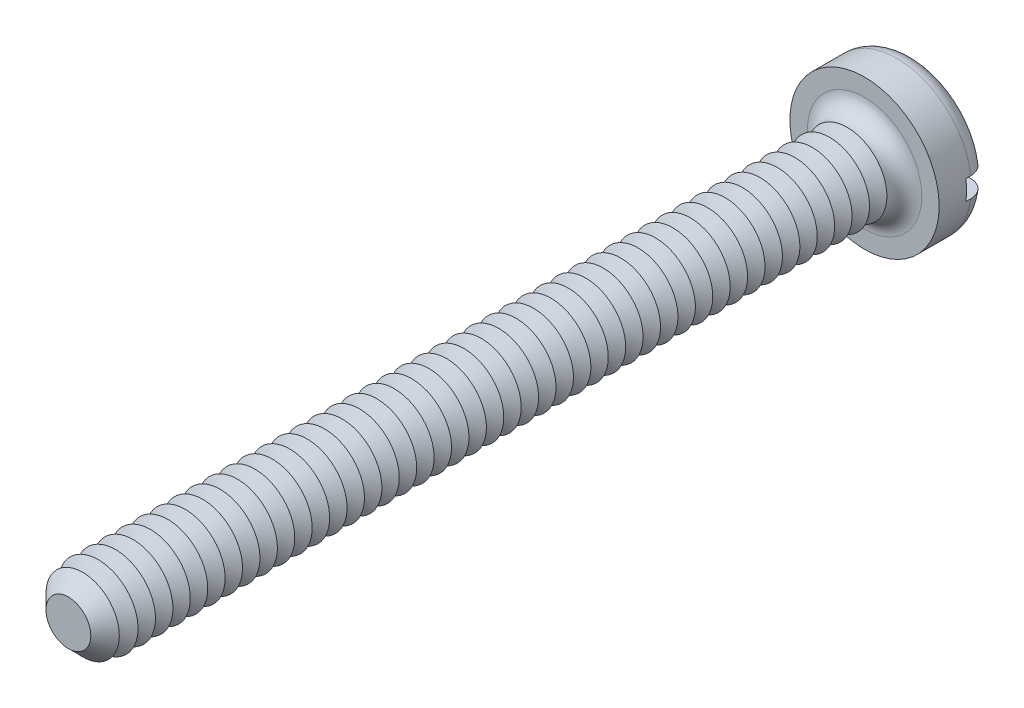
ISO-10303-21;
HEADER;
FILE_DESCRIPTION(('STEP AP214'),'2;1');
FILE_NAME('part.step','',(''),(''),'','','');
FILE_SCHEMA(('AUTOMOTIVE_DESIGN { 1 0 10303 214 1 1 1 1 }'));
ENDSEC;
DATA;
#1=APPLICATION_CONTEXT('core data for automotive mechanical design processes');
#2=APPLICATION_PROTOCOL_DEFINITION('international standard','automotive_design',2000,#1);
#3=PRODUCT_CONTEXT('',#1,'mechanical');
#4=PRODUCT('Part','Part','',(#3));
#5=PRODUCT_RELATED_PRODUCT_CATEGORY('part','',(#4));
#6=PRODUCT_DEFINITION_FORMATION('','',#4);
#7=PRODUCT_DEFINITION_CONTEXT('part definition',#1,'design');
#8=PRODUCT_DEFINITION('design','',#6,#7);
#9=PRODUCT_DEFINITION_SHAPE('','',#8);
#10=(LENGTH_UNIT() NAMED_UNIT(*) SI_UNIT(.MILLI.,.METRE.));
#11=(NAMED_UNIT(*) PLANE_ANGLE_UNIT() SI_UNIT($,.RADIAN.));
#12=(NAMED_UNIT(*) SI_UNIT($,.STERADIAN.) SOLID_ANGLE_UNIT());
#13=UNCERTAINTY_MEASURE_WITH_UNIT(LENGTH_MEASURE(1.E-05),#10,'distance_accuracy_value','');
#14=(GEOMETRIC_REPRESENTATION_CONTEXT(3) GLOBAL_UNCERTAINTY_ASSIGNED_CONTEXT((#13)) GLOBAL_UNIT_ASSIGNED_CONTEXT((#10,
#11,#12)) REPRESENTATION_CONTEXT('',''));
#15=CARTESIAN_POINT('',(0.,0.,0.));
#16=DIRECTION('',(0.,0.,1.));
#17=DIRECTION('',(1.,0.,0.));
#18=AXIS2_PLACEMENT_3D('',#15,#16,#17);
#19=CARTESIAN_POINT('',(0.,0.,-1.));
#20=DIRECTION('',(0.,0.,1.));
#21=DIRECTION('',(1.,0.,0.));
#22=AXIS2_PLACEMENT_3D('',#19,#20,#21);
#23=PLANE('',#22);
#24=CARTESIAN_POINT('',(0.,0.,-1.));
#25=DIRECTION('',(0.,0.,1.));
#26=DIRECTION('',(1.,0.,0.));
#27=AXIS2_PLACEMENT_3D('',#24,#25,#26);
#28=CIRCLE('',#27,1.15);
#29=CARTESIAN_POINT('',(-1.13247516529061,0.2,-1.));
#30=VERTEX_POINT('',#29);
#31=CARTESIAN_POINT('',(1.13247516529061,0.2,-1.));
#32=VERTEX_POINT('',#31);
#33=EDGE_CURVE('E116',#30,#32,#28,.F.);
#34=ORIENTED_EDGE('',*,*,#33,.T.);
#35=DIRECTION('',(1.,0.,0.));
#36=VECTOR('',#35,1.);
#37=CARTESIAN_POINT('',(-1.5,0.2,-1.));
#38=LINE('',#37,#36);
#39=EDGE_CURVE('E111',#30,#32,#38,.T.);
#40=ORIENTED_EDGE('',*,*,#39,.F.);
#41=EDGE_LOOP('',(#34,#40));
#42=FACE_BOUND('',#41,.T.);
#43=ADVANCED_FACE('F39',(#42),#23,.F.);
#44=CARTESIAN_POINT('',(0.,0.,-0.65));
#45=DIRECTION('',(0.,0.,1.));
#46=DIRECTION('',(1.,0.,0.));
#47=AXIS2_PLACEMENT_3D('',#44,#45,#46);
#48=TOROIDAL_SURFACE('',#47,1.15,0.35);
#49=CARTESIAN_POINT('',(-1.38697162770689,0.2,-0.89359719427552));
#50=CARTESIAN_POINT('',(-1.37305556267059,0.2,-0.907805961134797));
#51=CARTESIAN_POINT('',(-1.35791811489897,0.2,-0.9208403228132));
#52=CARTESIAN_POINT('',(-1.32565069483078,0.2,-0.944183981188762));
#53=CARTESIAN_POINT('',(-1.3085180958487,0.2,-0.954489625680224));
#54=CARTESIAN_POINT('',(-1.27278567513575,0.2,-0.972077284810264));
#55=CARTESIAN_POINT('',(-1.25418732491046,0.2,-0.979362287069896));
#56=CARTESIAN_POINT('',(-1.21604452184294,0.2,-0.990735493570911));
#57=CARTESIAN_POINT('',(-1.19650030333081,0.2,-0.994824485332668));
#58=CARTESIAN_POINT('',(-1.15682398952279,0.2,-0.99973845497));
#59=CARTESIAN_POINT('',(-1.1366881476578,0.2,-1.00053316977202));
#60=CARTESIAN_POINT('',(-1.09656272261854,0.2,-0.998770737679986));
#61=CARTESIAN_POINT('',(-1.07657315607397,0.2,-0.996213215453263));
#62=CARTESIAN_POINT('',(-1.03707277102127,0.2,-0.987780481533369));
#63=CARTESIAN_POINT('',(-1.01756977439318,0.2,-0.981868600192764));
#64=CARTESIAN_POINT('',(-0.979825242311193,0.2,-0.966867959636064));
#65=CARTESIAN_POINT('',(-0.961583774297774,0.2,-0.957779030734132));
#66=CARTESIAN_POINT('',(-0.926815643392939,0.2,-0.936628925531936));
#67=CARTESIAN_POINT('',(-0.910295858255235,0.2,-0.924556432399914));
#68=CARTESIAN_POINT('',(-0.879544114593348,0.2,-0.897781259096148));
#69=CARTESIAN_POINT('',(-0.8653120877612,0.2,-0.883078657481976));
#70=CARTESIAN_POINT('',(-0.83972745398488,0.2,-0.851619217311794));
#71=CARTESIAN_POINT('',(-0.8283448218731,0.2,-0.834886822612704));
#72=CARTESIAN_POINT('',(-0.80863848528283,0.2,-0.799707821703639));
#73=CARTESIAN_POINT('',(-0.80031425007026,0.2,-0.781261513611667));
#74=CARTESIAN_POINT('',(-0.787199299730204,0.2,-0.743695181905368));
#75=CARTESIAN_POINT('',(-0.782321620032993,0.2,-0.724605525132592));
#76=CARTESIAN_POINT('',(-0.775930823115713,0.2,-0.685871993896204));
#77=CARTESIAN_POINT('',(-0.774417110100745,0.2,-0.666228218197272));
#78=CARTESIAN_POINT('',(-0.774805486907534,0.2,-0.627456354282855));
#79=CARTESIAN_POINT('',(-0.776625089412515,0.2,-0.608327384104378));
#80=CARTESIAN_POINT('',(-0.783452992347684,0.2,-0.570648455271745));
#81=CARTESIAN_POINT('',(-0.788461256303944,0.2,-0.552098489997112));
#82=CARTESIAN_POINT('',(-0.801489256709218,0.2,-0.516098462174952));
#83=CARTESIAN_POINT('',(-0.809507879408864,0.2,-0.49864799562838));
#84=CARTESIAN_POINT('',(-0.828295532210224,0.2,-0.465297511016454));
#85=CARTESIAN_POINT('',(-0.839064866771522,0.2,-0.449397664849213));
#86=CARTESIAN_POINT('',(-0.863311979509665,0.2,-0.419196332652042));
#87=CARTESIAN_POINT('',(-0.876847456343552,0.2,-0.404941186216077));
#88=CARTESIAN_POINT('',(-0.906064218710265,0.2,-0.378832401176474));
#89=CARTESIAN_POINT('',(-0.921745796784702,0.2,-0.366979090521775));
#90=CARTESIAN_POINT('',(-0.955261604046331,0.2,-0.345690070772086));
#91=CARTESIAN_POINT('',(-0.973141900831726,0.2,-0.336326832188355));
#92=CARTESIAN_POINT('',(-1.01020647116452,0.2,-0.320690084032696));
#93=CARTESIAN_POINT('',(-1.02939085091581,0.2,-0.314416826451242));
#94=CARTESIAN_POINT('',(-1.06878849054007,0.2,-0.305073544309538));
#95=CARTESIAN_POINT('',(-1.0890118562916,0.2,-0.302046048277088));
#96=CARTESIAN_POINT('',(-1.12968032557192,0.2,-0.299436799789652));
#97=CARTESIAN_POINT('',(-1.15012542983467,0.2,-0.299855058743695));
#98=CARTESIAN_POINT('',(-1.1906059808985,0.2,-0.304138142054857));
#99=CARTESIAN_POINT('',(-1.21064224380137,0.2,-0.307995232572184));
#100=CARTESIAN_POINT('',(-1.24976957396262,0.2,-0.319055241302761));
#101=CARTESIAN_POINT('',(-1.26886068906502,0.2,-0.326257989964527));
#102=CARTESIAN_POINT('',(-1.30533597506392,0.2,-0.343725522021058));
#103=CARTESIAN_POINT('',(-1.32273620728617,0.2,-0.353956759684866));
#104=CARTESIAN_POINT('',(-1.35554323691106,0.2,-0.377229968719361));
#105=CARTESIAN_POINT('',(-1.37095016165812,0.2,-0.390271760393));
#106=CARTESIAN_POINT('',(-1.39913145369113,0.2,-0.418621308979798));
#107=CARTESIAN_POINT('',(-1.41193602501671,0.2,-0.43389904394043));
#108=CARTESIAN_POINT('',(-1.43476712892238,0.2,-0.46640589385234));
#109=CARTESIAN_POINT('',(-1.44479381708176,0.2,-0.483634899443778));
#110=CARTESIAN_POINT('',(-1.4616814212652,0.2,-0.519367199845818));
#111=CARTESIAN_POINT('',(-1.46857323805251,0.2,-0.537855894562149));
#112=CARTESIAN_POINT('',(-1.4791331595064,0.2,-0.575731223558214));
#113=CARTESIAN_POINT('',(-1.48280152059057,0.2,-0.595117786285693));
#114=CARTESIAN_POINT('',(-1.4867930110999,0.2,-0.634109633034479));
#115=CARTESIAN_POINT('',(-1.48713684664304,0.2,-0.653712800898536));
#116=CARTESIAN_POINT('',(-1.48452244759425,0.2,-0.692702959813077));
#117=CARTESIAN_POINT('',(-1.48156342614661,0.2,-0.712089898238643));
#118=CARTESIAN_POINT('',(-1.47243636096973,0.2,-0.75006822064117));
#119=CARTESIAN_POINT('',(-1.46627182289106,0.2,-0.768660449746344));
#120=CARTESIAN_POINT('',(-1.45092056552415,0.2,-0.804533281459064));
#121=CARTESIAN_POINT('',(-1.44173755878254,0.2,-0.821815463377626));
#122=CARTESIAN_POINT('',(-1.42477940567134,0.2,-0.848152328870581));
#123=CARTESIAN_POINT('',(-1.41786672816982,0.2,-0.857773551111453));
#124=CARTESIAN_POINT('',(-1.40310412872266,0.2,-0.876267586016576));
#125=CARTESIAN_POINT('',(-1.39525421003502,0.2,-0.885140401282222));
#126=CARTESIAN_POINT('',(-1.38697162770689,0.2,-0.89359719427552));
#127=B_SPLINE_CURVE_WITH_KNOTS('',3,(#49,#50,#51,#52,#53,#54,#55,#56,#57,#58,#59,#60,#61,#62,
#63,#64,#65,#66,#67,#68,#69,#70,#71,#72,#73,#74,#75,#76,#77,#78,#79,#80,#81,#82,#83,#84,#85,#86,
#87,#88,#89,#90,#91,#92,#93,#94,#95,#96,#97,#98,#99,#100,#101,#102,#103,#104,#105,#106,#107,
#108,#109,#110,#111,#112,#113,#114,#115,#116,#117,#118,#119,#120,#121,#122,#123,#124,#125,#126),
.UNSPECIFIED.,.T.,.F.,(4,2,2,2,2,2,2,2,2,2,2,2,2,2,2,2,2,2,2,2,2,2,2,2,2,2,2,2,2,2,2,2,2,2,2,2,
2,2,4),(0.,0.0596211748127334,0.119321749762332,0.178963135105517,0.238589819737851,
0.298763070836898,0.358943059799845,0.419793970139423,0.48064813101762,0.541736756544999,
0.602823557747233,0.663236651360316,0.72363925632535,0.782457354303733,0.841265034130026,
0.898637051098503,0.956008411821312,1.01335856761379,1.07071507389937,1.12941939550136,
1.18813172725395,1.24840147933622,1.30867614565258,1.36973127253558,1.43078660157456,
1.49170496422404,1.55262023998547,1.61288453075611,1.67314496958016,1.73266007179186,
1.792171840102,1.85108355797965,1.90999058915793,1.96853049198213,2.02708434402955,
2.08557429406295,2.14399257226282,2.17947810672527,2.21496351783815),.UNSPECIFIED.);
#128=CARTESIAN_POINT('',(-1.48660687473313,0.2,-0.649999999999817));
#129=VERTEX_POINT('',#128);
#130=EDGE_CURVE('E536',#129,#30,#127,.T.);
#131=ORIENTED_EDGE('',*,*,#130,.F.);
#132=CARTESIAN_POINT('',(0.,0.,-0.65));
#133=DIRECTION('',(0.,0.,1.));
#134=DIRECTION('',(1.,0.,0.));
#135=AXIS2_PLACEMENT_3D('',#132,#133,#134);
#136=CIRCLE('',#135,1.5);
#137=CARTESIAN_POINT('',(1.48660687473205,0.2,-0.649999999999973));
#138=VERTEX_POINT('',#137);
#139=EDGE_CURVE('E124',#138,#129,#136,.T.);
#140=ORIENTED_EDGE('',*,*,#139,.F.);
#141=CARTESIAN_POINT('',(0.780520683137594,0.2,-0.713112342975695));
#142=CARTESIAN_POINT('',(0.784146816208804,0.2,-0.73226748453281));
#143=CARTESIAN_POINT('',(0.789425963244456,0.2,-0.751125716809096));
#144=CARTESIAN_POINT('',(0.803106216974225,0.2,-0.78769198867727));
#145=CARTESIAN_POINT('',(0.811511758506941,0.2,-0.805398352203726));
#146=CARTESIAN_POINT('',(0.831144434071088,0.2,-0.839131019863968));
#147=CARTESIAN_POINT('',(0.842366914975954,0.2,-0.855160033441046));
#148=CARTESIAN_POINT('',(0.867288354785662,0.2,-0.88515062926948));
#149=CARTESIAN_POINT('',(0.880986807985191,0.2,-0.899112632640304));
#150=CARTESIAN_POINT('',(0.910770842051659,0.2,-0.924888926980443));
#151=CARTESIAN_POINT('',(0.926899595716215,0.2,-0.936653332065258));
#152=CARTESIAN_POINT('',(0.960871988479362,0.2,-0.957372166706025));
#153=CARTESIAN_POINT('',(0.978715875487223,0.2,-0.966326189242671));
#154=CARTESIAN_POINT('',(1.01600338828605,0.2,-0.981340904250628));
#155=CARTESIAN_POINT('',(1.03547204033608,0.2,-0.987339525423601));
#156=CARTESIAN_POINT('',(1.07513874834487,0.2,-0.995998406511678));
#157=CARTESIAN_POINT('',(1.09533683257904,0.2,-0.998658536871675));
#158=CARTESIAN_POINT('',(1.1359751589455,0.2,-1.0005575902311));
#159=CARTESIAN_POINT('',(1.1564160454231,0.2,-0.99978283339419));
#160=CARTESIAN_POINT('',(1.19687229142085,0.2,-0.994784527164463));
#161=CARTESIAN_POINT('',(1.21688766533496,0.2,-0.990561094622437));
#162=CARTESIAN_POINT('',(1.25575385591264,0.2,-0.978813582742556));
#163=CARTESIAN_POINT('',(1.27461259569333,0.2,-0.971315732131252));
#164=CARTESIAN_POINT('',(1.31078063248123,0.2,-0.953221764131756));
#165=CARTESIAN_POINT('',(1.32809002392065,0.2,-0.942625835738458));
#166=CARTESIAN_POINT('',(1.36044102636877,0.2,-0.918776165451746));
#167=CARTESIAN_POINT('',(1.37550786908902,0.2,-0.905556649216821));
#168=CARTESIAN_POINT('',(1.40317627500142,0.2,-0.876749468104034));
#169=CARTESIAN_POINT('',(1.41577799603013,0.2,-0.861161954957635));
#170=CARTESIAN_POINT('',(1.43800830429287,0.2,-0.828254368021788));
#171=CARTESIAN_POINT('',(1.44766923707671,0.2,-0.810956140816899));
#172=CARTESIAN_POINT('',(1.46392269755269,0.2,-0.774973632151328));
#173=CARTESIAN_POINT('',(1.4705153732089,0.2,-0.756289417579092));
#174=CARTESIAN_POINT('',(1.48039453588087,0.2,-0.718226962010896));
#175=CARTESIAN_POINT('',(1.48370713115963,0.2,-0.69885549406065));
#176=CARTESIAN_POINT('',(1.48701993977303,0.2,-0.659831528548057));
#177=CARTESIAN_POINT('',(1.4870202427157,0.2,-0.640179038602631));
#178=CARTESIAN_POINT('',(1.48371470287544,0.2,-0.6012267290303));
#179=CARTESIAN_POINT('',(1.48042091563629,0.2,-0.581925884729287));
#180=CARTESIAN_POINT('',(1.47064268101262,0.2,-0.544150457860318));
#181=CARTESIAN_POINT('',(1.46415824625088,0.2,-0.525675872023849));
#182=CARTESIAN_POINT('',(1.4481813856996,0.2,-0.490055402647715));
#183=CARTESIAN_POINT('',(1.43868601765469,0.2,-0.472910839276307));
#184=CARTESIAN_POINT('',(1.41696658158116,0.2,-0.440447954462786));
#185=CARTESIAN_POINT('',(1.40474246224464,0.2,-0.425129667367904));
#186=CARTESIAN_POINT('',(1.37784446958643,0.2,-0.39666049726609));
#187=CARTESIAN_POINT('',(1.36315749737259,0.2,-0.383521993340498));
#188=CARTESIAN_POINT('',(1.33180407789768,0.2,-0.359869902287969));
#189=CARTESIAN_POINT('',(1.31513754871,0.2,-0.349356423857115));
#190=CARTESIAN_POINT('',(1.28013085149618,0.2,-0.331143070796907));
#191=CARTESIAN_POINT('',(1.26177629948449,0.2,-0.323470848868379));
#192=CARTESIAN_POINT('',(1.224049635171,0.2,-0.311275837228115));
#193=CARTESIAN_POINT('',(1.20467746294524,0.2,-0.306753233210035));
#194=CARTESIAN_POINT('',(1.1652160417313,0.2,-0.300927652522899));
#195=CARTESIAN_POINT('',(1.14512096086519,0.2,-0.299664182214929));
#196=CARTESIAN_POINT('',(1.10499953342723,0.2,-0.300488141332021));
#197=CARTESIAN_POINT('',(1.08497319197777,0.2,-0.302575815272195));
#198=CARTESIAN_POINT('',(1.04531606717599,0.2,-0.310075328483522));
#199=CARTESIAN_POINT('',(1.0256923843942,0.2,-0.315524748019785));
#200=CARTESIAN_POINT('',(0.987629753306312,0.2,-0.329624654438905));
#201=CARTESIAN_POINT('',(0.96919087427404,0.2,-0.338275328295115));
#202=CARTESIAN_POINT('',(0.933939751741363,0.2,-0.358590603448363));
#203=CARTESIAN_POINT('',(0.917135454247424,0.2,-0.370269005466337));
#204=CARTESIAN_POINT('',(0.88574931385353,0.2,-0.396306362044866));
#205=CARTESIAN_POINT('',(0.87116734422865,0.2,-0.410665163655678));
#206=CARTESIAN_POINT('',(0.844813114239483,0.2,-0.441518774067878));
#207=CARTESIAN_POINT('',(0.833014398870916,0.2,-0.457990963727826));
#208=CARTESIAN_POINT('',(0.812431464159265,0.2,-0.492729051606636));
#209=CARTESIAN_POINT('',(0.803647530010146,0.2,-0.510995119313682));
#210=CARTESIAN_POINT('',(0.789590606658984,0.2,-0.548308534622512));
#211=CARTESIAN_POINT('',(0.784235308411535,0.2,-0.5673249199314));
#212=CARTESIAN_POINT('',(0.7768953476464,0.2,-0.605979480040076));
#213=CARTESIAN_POINT('',(0.774905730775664,0.2,-0.625616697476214));
#214=CARTESIAN_POINT('',(0.774470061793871,0.2,-0.656633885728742));
#215=CARTESIAN_POINT('',(0.7748847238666,0.2,-0.668009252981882));
#216=CARTESIAN_POINT('',(0.776852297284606,0.2,-0.690660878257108));
#217=CARTESIAN_POINT('',(0.77840517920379,0.2,-0.701937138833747));
#218=CARTESIAN_POINT('',(0.780520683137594,0.2,-0.713112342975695));
#219=B_SPLINE_CURVE_WITH_KNOTS('',3,(#141,#142,#143,#144,#145,#146,#147,#148,#149,#150,#151,
#152,#153,#154,#155,#156,#157,#158,#159,#160,#161,#162,#163,#164,#165,#166,#167,#168,#169,#170,
#171,#172,#173,#174,#175,#176,#177,#178,#179,#180,#181,#182,#183,#184,#185,#186,#187,#188,#189,
#190,#191,#192,#193,#194,#195,#196,#197,#198,#199,#200,#201,#202,#203,#204,#205,#206,#207,#208,
#209,#210,#211,#212,#213,#214,#215,#216,#217,#218),.UNSPECIFIED.,.T.,.F.,(4,2,2,2,2,2,2,2,2,2,2,
2,2,2,2,2,2,2,2,2,2,2,2,2,2,2,2,2,2,2,2,2,2,2,2,2,2,2,4),(0.,0.0584431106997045,
0.11696944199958,0.175399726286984,0.233818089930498,0.293433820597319,0.353058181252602,
0.413886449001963,0.474717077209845,0.53579018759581,0.596861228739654,0.65745180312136,
0.718038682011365,0.777881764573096,0.837721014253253,0.896876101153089,0.95602833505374,
1.01470585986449,1.07338179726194,1.13184377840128,1.19030552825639,1.24882458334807,
1.30734473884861,1.36618662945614,1.42503095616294,1.48443380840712,1.54384016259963,
1.60396331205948,1.66409084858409,1.72490303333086,1.78571877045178,1.84681674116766,
1.90791122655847,1.96839922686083,2.02889294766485,2.08787382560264,2.14676780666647,
2.18086468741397,2.21496068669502),.UNSPECIFIED.);
#220=EDGE_CURVE('E538',#32,#138,#219,.T.);
#221=ORIENTED_EDGE('',*,*,#220,.F.);
#222=ORIENTED_EDGE('',*,*,#33,.F.);
#223=EDGE_LOOP('',(#131,#140,#221,#222));
#224=FACE_BOUND('',#223,.T.);
#225=ADVANCED_FACE('F520',(#224),#48,.T.);
#226=CARTESIAN_POINT('',(0.,0.,-1.));
#227=DIRECTION('',(0.,0.,1.));
#228=DIRECTION('',(1.,0.,0.));
#229=AXIS2_PLACEMENT_3D('',#226,#227,#228);
#230=CYLINDRICAL_SURFACE('',#229,1.5);
#231=DIRECTION('',(0.,0.,1.));
#232=VECTOR('',#231,1.);
#233=CARTESIAN_POINT('',(1.48660687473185,0.2,-1.));
#234=LINE('',#233,#232);
#235=CARTESIAN_POINT('',(1.48660687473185,0.2,-0.55));
#236=VERTEX_POINT('',#235);
#237=EDGE_CURVE('E553',#138,#236,#234,.T.);
#238=ORIENTED_EDGE('',*,*,#237,.F.);
#239=ORIENTED_EDGE('',*,*,#139,.T.);
#240=DIRECTION('',(0.,0.,1.));
#241=VECTOR('',#240,1.);
#242=CARTESIAN_POINT('',(-1.48660687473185,0.2,-1.));
#243=LINE('',#242,#241);
#244=CARTESIAN_POINT('',(-1.48660687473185,0.2,-0.55));
#245=VERTEX_POINT('',#244);
#246=EDGE_CURVE('E63',#245,#129,#243,.F.);
#247=ORIENTED_EDGE('',*,*,#246,.F.);
#248=CARTESIAN_POINT('',(0.,0.,-0.55));
#249=DIRECTION('',(0.,0.,-1.));
#250=DIRECTION('',(-1.,0.,0.));
#251=AXIS2_PLACEMENT_3D('',#248,#249,#250);
#252=CIRCLE('',#251,1.5);
#253=CARTESIAN_POINT('',(-1.48660687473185,-0.2,-0.55));
#254=VERTEX_POINT('',#253);
#255=EDGE_CURVE('E43',#245,#254,#252,.F.);
#256=ORIENTED_EDGE('',*,*,#255,.T.);
#257=DIRECTION('',(0.,0.,1.));
#258=VECTOR('',#257,1.);
#259=CARTESIAN_POINT('',(-1.48660687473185,-0.2,-1.));
#260=LINE('',#259,#258);
#261=CARTESIAN_POINT('',(-1.48660687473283,-0.2,-0.650000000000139));
#262=VERTEX_POINT('',#261);
#263=EDGE_CURVE('E550',#262,#254,#260,.T.);
#264=ORIENTED_EDGE('',*,*,#263,.F.);
#265=CARTESIAN_POINT('',(1.48660687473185,-0.2,-0.65));
#266=VERTEX_POINT('',#265);
#267=EDGE_CURVE('E126',#262,#266,#136,.T.);
#268=ORIENTED_EDGE('',*,*,#267,.T.);
#269=DIRECTION('',(0.,0.,1.));
#270=VECTOR('',#269,1.);
#271=CARTESIAN_POINT('',(1.48660687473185,-0.2,-1.));
#272=LINE('',#271,#270);
#273=CARTESIAN_POINT('',(1.48660687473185,-0.2,-0.55));
#274=VERTEX_POINT('',#273);
#275=EDGE_CURVE('E55',#274,#266,#272,.F.);
#276=ORIENTED_EDGE('',*,*,#275,.F.);
#277=EDGE_CURVE('E11',#274,#236,#252,.F.);
#278=ORIENTED_EDGE('',*,*,#277,.T.);
#279=EDGE_LOOP('',(#238,#239,#247,#256,#264,#268,#276,#278));
#280=FACE_BOUND('',#279,.T.);
#281=CARTESIAN_POINT('',(0.,0.,0.));
#282=DIRECTION('',(0.,0.,1.));
#283=DIRECTION('',(1.,0.,0.));
#284=AXIS2_PLACEMENT_3D('',#281,#282,#283);
#285=CIRCLE('',#284,1.5);
#286=CARTESIAN_POINT('',(1.5,0.,0.));
#287=VERTEX_POINT('',#286);
#288=EDGE_CURVE('E556',#287,#287,#285,.T.);
#289=ORIENTED_EDGE('',*,*,#288,.F.);
#290=EDGE_LOOP('',(#289));
#291=FACE_BOUND('',#290,.T.);
#292=ADVANCED_FACE('F516',(#280,#291),#230,.T.);
#293=CARTESIAN_POINT('',(1.13247516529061,-0.2,-1.));
#294=VERTEX_POINT('',#293);
#295=CARTESIAN_POINT('',(-1.13247516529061,-0.2,-1.));
#296=VERTEX_POINT('',#295);
#297=EDGE_CURVE('E109',#294,#296,#28,.F.);
#298=ORIENTED_EDGE('',*,*,#297,.T.);
#299=DIRECTION('',(-1.,0.,0.));
#300=VECTOR('',#299,1.);
#301=CARTESIAN_POINT('',(-1.5,-0.2,-1.));
#302=LINE('',#301,#300);
#303=EDGE_CURVE('E96',#294,#296,#302,.T.);
#304=ORIENTED_EDGE('',*,*,#303,.F.);
#305=EDGE_LOOP('',(#298,#304));
#306=FACE_BOUND('',#305,.T.);
#307=ADVANCED_FACE('F108',(#306),#23,.F.);
#308=CARTESIAN_POINT('',(0.,0.,0.));
#309=DIRECTION('',(0.,0.,1.));
#310=DIRECTION('',(1.,0.,0.));
#311=AXIS2_PLACEMENT_3D('',#308,#309,#310);
#312=PLANE('',#311);
#313=CARTESIAN_POINT('',(0.,0.,0.));
#314=DIRECTION('',(0.,0.,1.));
#315=DIRECTION('',(1.,0.,0.));
#316=AXIS2_PLACEMENT_3D('',#313,#314,#315);
#317=CIRCLE('',#316,1.15);
#318=CARTESIAN_POINT('',(1.15,0.,0.));
#319=VERTEX_POINT('',#318);
#320=EDGE_CURVE('E115',#319,#319,#317,.F.);
#321=ORIENTED_EDGE('',*,*,#320,.T.);
#322=EDGE_LOOP('',(#321));
#323=FACE_BOUND('',#322,.T.);
#324=ORIENTED_EDGE('',*,*,#288,.T.);
#325=EDGE_LOOP('',(#324));
#326=FACE_BOUND('',#325,.T.);
#327=ADVANCED_FACE('F515',(#323,#326),#312,.T.);
#328=CARTESIAN_POINT('',(-1.38697162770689,-0.2,-0.89359719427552));
#329=CARTESIAN_POINT('',(-1.40068341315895,-0.2,-0.87959447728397));
#330=CARTESIAN_POINT('',(-1.41322919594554,-0.2,-0.864431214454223));
#331=CARTESIAN_POINT('',(-1.43561095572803,-0.2,-0.83220389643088));
#332=CARTESIAN_POINT('',(-1.44544396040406,-0.2,-0.815137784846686));
#333=CARTESIAN_POINT('',(-1.46209732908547,-0.2,-0.779595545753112));
#334=CARTESIAN_POINT('',(-1.46891825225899,-0.2,-0.761119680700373));
#335=CARTESIAN_POINT('',(-1.479344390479,-0.2,-0.723286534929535));
#336=CARTESIAN_POINT('',(-1.48295036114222,-0.2,-0.703929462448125));
#337=CARTESIAN_POINT('',(-1.48683413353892,-0.2,-0.6649653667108));
#338=CARTESIAN_POINT('',(-1.48712565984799,-0.2,-0.645359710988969));
#339=CARTESIAN_POINT('',(-1.48440736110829,-0.2,-0.606378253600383));
#340=CARTESIAN_POINT('',(-1.48139747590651,-0.2,-0.587002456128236));
#341=CARTESIAN_POINT('',(-1.47217267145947,-0.2,-0.549061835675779));
#342=CARTESIAN_POINT('',(-1.46596274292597,-0.2,-0.530495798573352));
#343=CARTESIAN_POINT('',(-1.45052327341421,-0.2,-0.494665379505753));
#344=CARTESIAN_POINT('',(-1.44129371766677,-0.2,-0.477401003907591));
#345=CARTESIAN_POINT('',(-1.42005139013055,-0.2,-0.444603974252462));
#346=CARTESIAN_POINT('',(-1.40803014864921,-0.2,-0.429076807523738));
#347=CARTESIAN_POINT('',(-1.38156905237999,-0.2,-0.400242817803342));
#348=CARTESIAN_POINT('',(-1.36712913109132,-0.2,-0.386936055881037));
#349=CARTESIAN_POINT('',(-1.33612890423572,-0.2,-0.362811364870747));
#350=CARTESIAN_POINT('',(-1.31955365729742,-0.2,-0.352012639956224));
#351=CARTESIAN_POINT('',(-1.28484098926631,-0.2,-0.333316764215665));
#352=CARTESIAN_POINT('',(-1.26670348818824,-0.2,-0.325419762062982));
#353=CARTESIAN_POINT('',(-1.22917040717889,-0.2,-0.31265726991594));
#354=CARTESIAN_POINT('',(-1.20976324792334,-0.2,-0.3078258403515));
#355=CARTESIAN_POINT('',(-1.17041685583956,-0.2,-0.30144641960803));
#356=CARTESIAN_POINT('',(-1.15047758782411,-0.2,-0.299898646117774));
#357=CARTESIAN_POINT('',(-1.11037109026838,-0.2,-0.300112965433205));
#358=CARTESIAN_POINT('',(-1.09020407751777,-0.2,-0.301916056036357));
#359=CARTESIAN_POINT('',(-1.05044996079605,-0.2,-0.308849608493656));
#360=CARTESIAN_POINT('',(-1.03086289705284,-0.2,-0.313980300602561));
#361=CARTESIAN_POINT('',(-0.992636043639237,-0.2,-0.327485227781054));
#362=CARTESIAN_POINT('',(-0.974006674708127,-0.2,-0.335888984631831));
#363=CARTESIAN_POINT('',(-0.938423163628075,-0.2,-0.355707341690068));
#364=CARTESIAN_POINT('',(-0.921469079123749,-0.2,-0.367122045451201));
#365=CARTESIAN_POINT('',(-0.889752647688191,-0.2,-0.392642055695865));
#366=CARTESIAN_POINT('',(-0.874987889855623,-0.2,-0.406744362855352));
#367=CARTESIAN_POINT('',(-0.848085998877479,-0.2,-0.437266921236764));
#368=CARTESIAN_POINT('',(-0.835948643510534,-0.2,-0.453686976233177));
#369=CARTESIAN_POINT('',(-0.814894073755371,-0.2,-0.488078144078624));
#370=CARTESIAN_POINT('',(-0.805923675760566,-0.2,-0.506016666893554));
#371=CARTESIAN_POINT('',(-0.791223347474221,-0.2,-0.543175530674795));
#372=CARTESIAN_POINT('',(-0.78549275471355,-0.2,-0.562395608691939));
#373=CARTESIAN_POINT('',(-0.777599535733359,-0.2,-0.600984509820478));
#374=CARTESIAN_POINT('',(-0.775340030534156,-0.2,-0.62033354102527));
#375=CARTESIAN_POINT('',(-0.774164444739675,-0.2,-0.659131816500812));
#376=CARTESIAN_POINT('',(-0.775247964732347,-0.2,-0.678581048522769));
#377=CARTESIAN_POINT('',(-0.78067015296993,-0.2,-0.716679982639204));
#378=CARTESIAN_POINT('',(-0.784953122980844,-0.2,-0.735337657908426));
#379=CARTESIAN_POINT('',(-0.796558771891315,-0.2,-0.771681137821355));
#380=CARTESIAN_POINT('',(-0.803881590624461,-0.2,-0.789366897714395));
#381=CARTESIAN_POINT('',(-0.821417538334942,-0.2,-0.823475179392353));
#382=CARTESIAN_POINT('',(-0.831660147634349,-0.2,-0.839882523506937));
#383=CARTESIAN_POINT('',(-0.854684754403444,-0.2,-0.870805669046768));
#384=CARTESIAN_POINT('',(-0.867467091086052,-0.2,-0.885321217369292));
#385=CARTESIAN_POINT('',(-0.895584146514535,-0.2,-0.912470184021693));
#386=CARTESIAN_POINT('',(-0.910979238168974,-0.2,-0.925041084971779));
#387=CARTESIAN_POINT('',(-0.943622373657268,-0.2,-0.947488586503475));
#388=CARTESIAN_POINT('',(-0.960870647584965,-0.2,-0.957364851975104));
#389=CARTESIAN_POINT('',(-0.997151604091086,-0.2,-0.974359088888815));
#390=CARTESIAN_POINT('',(-1.01621564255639,-0.2,-0.98141019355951));
#391=CARTESIAN_POINT('',(-1.05525219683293,-0.2,-0.992235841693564));
#392=CARTESIAN_POINT('',(-1.07522472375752,-0.2,-0.996010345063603));
#393=CARTESIAN_POINT('',(-1.11565152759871,-0.2,-1.00018247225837));
#394=CARTESIAN_POINT('',(-1.1361080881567,-0.2,-1.00055804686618));
#395=CARTESIAN_POINT('',(-1.17679659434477,-0.2,-0.997846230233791));
#396=CARTESIAN_POINT('',(-1.19702848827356,-0.2,-0.994758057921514));
#397=CARTESIAN_POINT('',(-1.23655375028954,-0.2,-0.985216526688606));
#398=CARTESIAN_POINT('',(-1.25585198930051,-0.2,-0.978783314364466));
#399=CARTESIAN_POINT('',(-1.29305658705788,-0.2,-0.962732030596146));
#400=CARTESIAN_POINT('',(-1.31096467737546,-0.2,-0.953118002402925));
#401=CARTESIAN_POINT('',(-1.33859353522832,-0.2,-0.935076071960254));
#402=CARTESIAN_POINT('',(-1.34889525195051,-0.2,-0.927521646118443));
#403=CARTESIAN_POINT('',(-1.36861998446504,-0.2,-0.911341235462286));
#404=CARTESIAN_POINT('',(-1.37804300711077,-0.2,-0.90271525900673));
#405=CARTESIAN_POINT('',(-1.38697162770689,-0.2,-0.89359719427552));
#406=B_SPLINE_CURVE_WITH_KNOTS('',3,(#328,#329,#330,#331,#332,#333,#334,#335,#336,#337,#338,
#339,#340,#341,#342,#343,#344,#345,#346,#347,#348,#349,#350,#351,#352,#353,#354,#355,#356,#357,
#358,#359,#360,#361,#362,#363,#364,#365,#366,#367,#368,#369,#370,#371,#372,#373,#374,#375,#376,
#377,#378,#379,#380,#381,#382,#383,#384,#385,#386,#387,#388,#389,#390,#391,#392,#393,#394,#395,
#396,#397,#398,#399,#400,#401,#402,#403,#404,#405),.UNSPECIFIED.,.T.,.F.,(4,2,2,2,2,2,2,2,2,2,2,
2,2,2,2,2,2,2,2,2,2,2,2,2,2,2,2,2,2,2,2,2,2,2,2,2,2,2,4),(0.,0.0587484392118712,
0.117560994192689,0.17636262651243,0.235150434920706,0.293694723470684,0.352240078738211,
0.410694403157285,0.46914901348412,0.527783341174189,0.586419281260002,0.645490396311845,
0.704564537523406,0.76428403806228,0.824007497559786,0.884466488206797,0.944929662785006,
1.00595131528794,1.06697506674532,1.12793111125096,1.18888199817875,1.2487542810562,
1.30861431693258,1.36677117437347,1.4249210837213,1.48208160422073,1.53924475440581,
1.59700685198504,1.65477666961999,1.71413044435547,1.77349159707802,1.83418476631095,
1.89487867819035,1.95596603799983,2.01706717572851,2.07780450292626,2.13846491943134,
2.17672008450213,2.21497495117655),.UNSPECIFIED.);
#407=EDGE_CURVE('E103',#296,#262,#406,.T.);
#408=ORIENTED_EDGE('',*,*,#407,.F.);
#409=ORIENTED_EDGE('',*,*,#297,.F.);
#410=CARTESIAN_POINT('',(0.780520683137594,-0.2,-0.713112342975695));
#411=CARTESIAN_POINT('',(0.776967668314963,-0.2,-0.694332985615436));
#412=CARTESIAN_POINT('',(0.774997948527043,-0.2,-0.675240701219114));
#413=CARTESIAN_POINT('',(0.774305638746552,-0.2,-0.636983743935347));
#414=CARTESIAN_POINT('',(0.775586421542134,-0.2,-0.617819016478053));
#415=CARTESIAN_POINT('',(0.781350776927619,-0.2,-0.579992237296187));
#416=CARTESIAN_POINT('',(0.78583187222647,-0.2,-0.56132980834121));
#417=CARTESIAN_POINT('',(0.797836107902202,-0.2,-0.525016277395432));
#418=CARTESIAN_POINT('',(0.805358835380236,-0.2,-0.507365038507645));
#419=CARTESIAN_POINT('',(0.823276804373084,-0.2,-0.47338978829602));
#420=CARTESIAN_POINT('',(0.833696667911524,-0.2,-0.457078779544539));
#421=CARTESIAN_POINT('',(0.857057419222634,-0.2,-0.426375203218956));
#422=CARTESIAN_POINT('',(0.869998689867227,-0.2,-0.411982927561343));
#423=CARTESIAN_POINT('',(0.898418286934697,-0.2,-0.38510575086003));
#424=CARTESIAN_POINT('',(0.913956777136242,-0.2,-0.372684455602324));
#425=CARTESIAN_POINT('',(0.946860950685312,-0.2,-0.350558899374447));
#426=CARTESIAN_POINT('',(0.964226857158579,-0.2,-0.340854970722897));
#427=CARTESIAN_POINT('',(1.00070854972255,-0.2,-0.324232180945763));
#428=CARTESIAN_POINT('',(1.01985442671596,-0.2,-0.317379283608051));
#429=CARTESIAN_POINT('',(1.0590214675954,-0.2,-0.306962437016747));
#430=CARTESIAN_POINT('',(1.07904267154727,-0.2,-0.303398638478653));
#431=CARTESIAN_POINT('',(1.11952320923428,-0.2,-0.299657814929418));
#432=CARTESIAN_POINT('',(1.13998446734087,-0.2,-0.299501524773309));
#433=CARTESIAN_POINT('',(1.1806395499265,-0.2,-0.302650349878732));
#434=CARTESIAN_POINT('',(1.20083338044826,-0.2,-0.305955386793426));
#435=CARTESIAN_POINT('',(1.24023260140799,-0.2,-0.315918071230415));
#436=CARTESIAN_POINT('',(1.25944372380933,-0.2,-0.322553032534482));
#437=CARTESIAN_POINT('',(1.29645854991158,-0.2,-0.338992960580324));
#438=CARTESIAN_POINT('',(1.31426233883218,-0.2,-0.348797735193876));
#439=CARTESIAN_POINT('',(1.34772734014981,-0.2,-0.371172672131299));
#440=CARTESIAN_POINT('',(1.36341179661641,-0.2,-0.383708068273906));
#441=CARTESIAN_POINT('',(1.39242189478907,-0.2,-0.41126267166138));
#442=CARTESIAN_POINT('',(1.40574768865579,-0.2,-0.426281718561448));
#443=CARTESIAN_POINT('',(1.42949833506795,-0.2,-0.458186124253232));
#444=CARTESIAN_POINT('',(1.43995542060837,-0.2,-0.475047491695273));
#445=CARTESIAN_POINT('',(1.45786189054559,-0.2,-0.510298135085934));
#446=CARTESIAN_POINT('',(1.46531142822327,-0.2,-0.528687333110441));
#447=CARTESIAN_POINT('',(1.47692889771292,-0.2,-0.566301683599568));
#448=CARTESIAN_POINT('',(1.48112438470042,-0.2,-0.585518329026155));
#449=CARTESIAN_POINT('',(1.48621428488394,-0.2,-0.624383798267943));
#450=CARTESIAN_POINT('',(1.48710879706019,-0.2,-0.644032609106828));
#451=CARTESIAN_POINT('',(1.48557356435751,-0.2,-0.683115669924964));
#452=CARTESIAN_POINT('',(1.48315796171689,-0.2,-0.702550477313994));
#453=CARTESIAN_POINT('',(1.47509909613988,-0.2,-0.740738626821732));
#454=CARTESIAN_POINT('',(1.46945585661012,-0.2,-0.759491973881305));
#455=CARTESIAN_POINT('',(1.45510530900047,-0.2,-0.79579446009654));
#456=CARTESIAN_POINT('',(1.44639690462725,-0.2,-0.813343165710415));
#457=CARTESIAN_POINT('',(1.42617120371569,-0.2,-0.846738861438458));
#458=CARTESIAN_POINT('',(1.41465386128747,-0.2,-0.862585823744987));
#459=CARTESIAN_POINT('',(1.3890808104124,-0.2,-0.892214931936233));
#460=CARTESIAN_POINT('',(1.37501291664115,-0.2,-0.90598655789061));
#461=CARTESIAN_POINT('',(1.34478283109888,-0.2,-0.930997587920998));
#462=CARTESIAN_POINT('',(1.32862056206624,-0.2,-0.942236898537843));
#463=CARTESIAN_POINT('',(1.29450693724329,-0.2,-0.96197581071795));
#464=CARTESIAN_POINT('',(1.27654077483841,-0.2,-0.970449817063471));
#465=CARTESIAN_POINT('',(1.23945233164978,-0.2,-0.984300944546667));
#466=CARTESIAN_POINT('',(1.2203299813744,-0.2,-0.989677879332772));
#467=CARTESIAN_POINT('',(1.18123021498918,-0.2,-0.997250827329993));
#468=CARTESIAN_POINT('',(1.16124534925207,-0.2,-0.999408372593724));
#469=CARTESIAN_POINT('',(1.12119456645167,-0.2,-1.00037966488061));
#470=CARTESIAN_POINT('',(1.10112864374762,-0.2,-0.999193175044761));
#471=CARTESIAN_POINT('',(1.06123417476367,-0.2,-0.993489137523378));
#472=CARTESIAN_POINT('',(1.0414112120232,-0.2,-0.988932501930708));
#473=CARTESIAN_POINT('',(1.00280276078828,-0.2,-0.976576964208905));
#474=CARTESIAN_POINT('',(0.984017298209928,-0.2,-0.968777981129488));
#475=CARTESIAN_POINT('',(0.947906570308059,-0.2,-0.95009587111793));
#476=CARTESIAN_POINT('',(0.930590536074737,-0.2,-0.939194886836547));
#477=CARTESIAN_POINT('',(0.89804559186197,-0.2,-0.914617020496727));
#478=CARTESIAN_POINT('',(0.882817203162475,-0.2,-0.900939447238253));
#479=CARTESIAN_POINT('',(0.855020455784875,-0.2,-0.871287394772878));
#480=CARTESIAN_POINT('',(0.84243415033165,-0.2,-0.855329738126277));
#481=CARTESIAN_POINT('',(0.820210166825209,-0.2,-0.821497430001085));
#482=CARTESIAN_POINT('',(0.810568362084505,-0.2,-0.803625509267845));
#483=CARTESIAN_POINT('',(0.797588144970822,-0.2,-0.773519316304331));
#484=CARTESIAN_POINT('',(0.793244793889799,-0.2,-0.761708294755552));
#485=CARTESIAN_POINT('',(0.785879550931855,-0.2,-0.737680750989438));
#486=CARTESIAN_POINT('',(0.782857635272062,-0.2,-0.725464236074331));
#487=CARTESIAN_POINT('',(0.780520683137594,-0.2,-0.713112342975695));
#488=B_SPLINE_CURVE_WITH_KNOTS('',3,(#410,#411,#412,#413,#414,#415,#416,#417,#418,#419,#420,
#421,#422,#423,#424,#425,#426,#427,#428,#429,#430,#431,#432,#433,#434,#435,#436,#437,#438,#439,
#440,#441,#442,#443,#444,#445,#446,#447,#448,#449,#450,#451,#452,#453,#454,#455,#456,#457,#458,
#459,#460,#461,#462,#463,#464,#465,#466,#467,#468,#469,#470,#471,#472,#473,#474,#475,#476,#477,
#478,#479,#480,#481,#482,#483,#484,#485,#486,#487),.UNSPECIFIED.,.T.,.F.,(4,2,2,2,2,2,2,2,2,2,2,
2,2,2,2,2,2,2,2,2,2,2,2,2,2,2,2,2,2,2,2,2,2,2,2,2,2,2,4),(0.,0.057291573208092,
0.114642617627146,0.171949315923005,0.229248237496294,0.287049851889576,0.344860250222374,
0.404266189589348,0.463679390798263,0.524399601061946,0.585122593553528,0.646214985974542,
0.707305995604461,0.767986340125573,0.828663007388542,0.888608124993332,0.948549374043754,
1.00778662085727,1.06702084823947,1.12574783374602,1.18447305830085,1.24294816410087,
1.30142284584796,1.35991846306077,1.41841503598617,1.47719881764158,1.5359847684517,
1.59530034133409,1.65461948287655,1.71464189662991,1.77466856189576,1.83540257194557,
1.89613809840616,1.9572305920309,2.01833831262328,2.0790164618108,2.13960917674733,
2.17729268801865,2.21497552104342),.UNSPECIFIED.);
#489=EDGE_CURVE('E92',#266,#294,#488,.T.);
#490=ORIENTED_EDGE('',*,*,#489,.F.);
#491=ORIENTED_EDGE('',*,*,#267,.F.);
#492=EDGE_LOOP('',(#408,#409,#490,#491));
#493=FACE_BOUND('',#492,.T.);
#494=ADVANCED_FACE('F113',(#493),#48,.T.);
#495=CARTESIAN_POINT('',(0.,0.,0.35));
#496=DIRECTION('',(0.,0.,1.));
#497=DIRECTION('',(1.,0.,0.));
#498=AXIS2_PLACEMENT_3D('',#495,#496,#497);
#499=TOROIDAL_SURFACE('',#498,1.15,0.35);
#500=ORIENTED_EDGE('',*,*,#320,.F.);
#501=EDGE_LOOP('',(#500));
#502=FACE_BOUND('',#501,.T.);
#503=CARTESIAN_POINT('',(0.,0.,0.35));
#504=DIRECTION('',(0.,0.,-1.));
#505=DIRECTION('',(-1.,0.,0.));
#506=AXIS2_PLACEMENT_3D('',#503,#504,#505);
#507=CIRCLE('',#506,0.8);
#508=CARTESIAN_POINT('',(-0.8,0.,0.35));
#509=VERTEX_POINT('',#508);
#510=EDGE_CURVE('E562',#509,#509,#507,.T.);
#511=ORIENTED_EDGE('',*,*,#510,.T.);
#512=EDGE_LOOP('',(#511));
#513=FACE_BOUND('',#512,.T.);
#514=ADVANCED_FACE('F508',(#502,#513),#499,.F.);
#515=CARTESIAN_POINT('',(0.,0.,0.524999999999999));
#516=DIRECTION('',(0.,0.,-1.));
#517=DIRECTION('',(-1.,0.,0.));
#518=AXIS2_PLACEMENT_3D('',#515,#516,#517);
#519=CONICAL_SURFACE('',#518,0.496891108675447,1.0471975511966);
#520=ORIENTED_EDGE('',*,*,#510,.F.);
#521=EDGE_LOOP('',(#520));
#522=FACE_BOUND('',#521,.T.);
#523=CARTESIAN_POINT('',(0.,0.,0.524999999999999));
#524=DIRECTION('',(0.,0.,-1.));
#525=DIRECTION('',(-1.,0.,0.));
#526=AXIS2_PLACEMENT_3D('',#523,#524,#525);
#527=CIRCLE('',#526,0.496891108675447);
#528=CARTESIAN_POINT('',(-0.496891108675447,0.,0.524999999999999));
#529=VERTEX_POINT('',#528);
#530=EDGE_CURVE('E569',#529,#529,#527,.T.);
#531=ORIENTED_EDGE('',*,*,#530,.T.);
#532=EDGE_LOOP('',(#531));
#533=FACE_BOUND('',#532,.T.);
#534=ADVANCED_FACE('F504',(#522,#533),#519,.T.);
#535=CARTESIAN_POINT('',(0.,0.,0.7));
#536=DIRECTION('',(0.,0.,1.));
#537=DIRECTION('',(1.,0.,0.));
#538=AXIS2_PLACEMENT_3D('',#535,#536,#537);
#539=CONICAL_SURFACE('',#538,0.8,1.0471975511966);
#540=ORIENTED_EDGE('',*,*,#530,.F.);
#541=EDGE_LOOP('',(#540));
#542=FACE_BOUND('',#541,.T.);
#543=CARTESIAN_POINT('',(0.,0.,0.7));
#544=DIRECTION('',(0.,0.,-1.));
#545=DIRECTION('',(-1.,0.,0.));
#546=AXIS2_PLACEMENT_3D('',#543,#544,#545);
#547=CIRCLE('',#546,0.8);
#548=CARTESIAN_POINT('',(-0.8,0.,0.7));
#549=VERTEX_POINT('',#548);
#550=EDGE_CURVE('E575',#549,#549,#547,.T.);
#551=ORIENTED_EDGE('',*,*,#550,.T.);
#552=EDGE_LOOP('',(#551));
#553=FACE_BOUND('',#552,.T.);
#554=ADVANCED_FACE('F500',(#542,#553),#539,.T.);
#555=CARTESIAN_POINT('',(0.,0.,0.874999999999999));
#556=DIRECTION('',(0.,0.,-1.));
#557=DIRECTION('',(-1.,0.,0.));
#558=AXIS2_PLACEMENT_3D('',#555,#556,#557);
#559=CONICAL_SURFACE('',#558,0.496891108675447,1.0471975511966);
#560=ORIENTED_EDGE('',*,*,#550,.F.);
#561=EDGE_LOOP('',(#560));
#562=FACE_BOUND('',#561,.T.);
#563=CARTESIAN_POINT('',(0.,0.,0.874999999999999));
#564=DIRECTION('',(0.,0.,-1.));
#565=DIRECTION('',(-1.,0.,0.));
#566=AXIS2_PLACEMENT_3D('',#563,#564,#565);
#567=CIRCLE('',#566,0.496891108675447);
#568=CARTESIAN_POINT('',(-0.496891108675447,0.,0.874999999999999));
#569=VERTEX_POINT('',#568);
#570=EDGE_CURVE('E578',#569,#569,#567,.T.);
#571=ORIENTED_EDGE('',*,*,#570,.T.);
#572=EDGE_LOOP('',(#571));
#573=FACE_BOUND('',#572,.T.);
#574=ADVANCED_FACE('F496',(#562,#573),#559,.T.);
#575=CARTESIAN_POINT('',(0.,0.,1.05));
#576=DIRECTION('',(0.,0.,1.));
#577=DIRECTION('',(1.,0.,0.));
#578=AXIS2_PLACEMENT_3D('',#575,#576,#577);
#579=CONICAL_SURFACE('',#578,0.8,1.0471975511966);
#580=ORIENTED_EDGE('',*,*,#570,.F.);
#581=EDGE_LOOP('',(#580));
#582=FACE_BOUND('',#581,.T.);
#583=CARTESIAN_POINT('',(0.,0.,1.05));
#584=DIRECTION('',(0.,0.,-1.));
#585=DIRECTION('',(-1.,0.,0.));
#586=AXIS2_PLACEMENT_3D('',#583,#584,#585);
#587=CIRCLE('',#586,0.8);
#588=CARTESIAN_POINT('',(-0.8,0.,1.05));
#589=VERTEX_POINT('',#588);
#590=EDGE_CURVE('E582',#589,#589,#587,.T.);
#591=ORIENTED_EDGE('',*,*,#590,.T.);
#592=EDGE_LOOP('',(#591));
#593=FACE_BOUND('',#592,.T.);
#594=ADVANCED_FACE('F492',(#582,#593),#579,.T.);
#595=CARTESIAN_POINT('',(0.,0.,1.225));
#596=DIRECTION('',(0.,0.,-1.));
#597=DIRECTION('',(-1.,0.,0.));
#598=AXIS2_PLACEMENT_3D('',#595,#596,#597);
#599=CONICAL_SURFACE('',#598,0.496891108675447,1.0471975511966);
#600=ORIENTED_EDGE('',*,*,#590,.F.);
#601=EDGE_LOOP('',(#600));
#602=FACE_BOUND('',#601,.T.);
#603=CARTESIAN_POINT('',(0.,0.,1.225));
#604=DIRECTION('',(0.,0.,-1.));
#605=DIRECTION('',(-1.,0.,0.));
#606=AXIS2_PLACEMENT_3D('',#603,#604,#605);
#607=CIRCLE('',#606,0.496891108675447);
#608=CARTESIAN_POINT('',(-0.496891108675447,0.,1.225));
#609=VERTEX_POINT('',#608);
#610=EDGE_CURVE('E586',#609,#609,#607,.T.);
#611=ORIENTED_EDGE('',*,*,#610,.T.);
#612=EDGE_LOOP('',(#611));
#613=FACE_BOUND('',#612,.T.);
#614=ADVANCED_FACE('F488',(#602,#613),#599,.T.);
#615=CARTESIAN_POINT('',(0.,0.,1.4));
#616=DIRECTION('',(0.,0.,1.));
#617=DIRECTION('',(1.,0.,0.));
#618=AXIS2_PLACEMENT_3D('',#615,#616,#617);
#619=CONICAL_SURFACE('',#618,0.8,1.0471975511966);
#620=ORIENTED_EDGE('',*,*,#610,.F.);
#621=EDGE_LOOP('',(#620));
#622=FACE_BOUND('',#621,.T.);
#623=CARTESIAN_POINT('',(0.,0.,1.4));
#624=DIRECTION('',(0.,0.,-1.));
#625=DIRECTION('',(-1.,0.,0.));
#626=AXIS2_PLACEMENT_3D('',#623,#624,#625);
#627=CIRCLE('',#626,0.8);
#628=CARTESIAN_POINT('',(-0.8,0.,1.4));
#629=VERTEX_POINT('',#628);
#630=EDGE_CURVE('E590',#629,#629,#627,.T.);
#631=ORIENTED_EDGE('',*,*,#630,.T.);
#632=EDGE_LOOP('',(#631));
#633=FACE_BOUND('',#632,.T.);
#634=ADVANCED_FACE('F484',(#622,#633),#619,.T.);
#635=CARTESIAN_POINT('',(0.,0.,1.575));
#636=DIRECTION('',(0.,0.,-1.));
#637=DIRECTION('',(-1.,0.,0.));
#638=AXIS2_PLACEMENT_3D('',#635,#636,#637);
#639=CONICAL_SURFACE('',#638,0.496891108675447,1.0471975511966);
#640=ORIENTED_EDGE('',*,*,#630,.F.);
#641=EDGE_LOOP('',(#640));
#642=FACE_BOUND('',#641,.T.);
#643=CARTESIAN_POINT('',(0.,0.,1.575));
#644=DIRECTION('',(0.,0.,-1.));
#645=DIRECTION('',(-1.,0.,0.));
#646=AXIS2_PLACEMENT_3D('',#643,#644,#645);
#647=CIRCLE('',#646,0.496891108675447);
#648=CARTESIAN_POINT('',(-0.496891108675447,0.,1.575));
#649=VERTEX_POINT('',#648);
#650=EDGE_CURVE('E594',#649,#649,#647,.T.);
#651=ORIENTED_EDGE('',*,*,#650,.T.);
#652=EDGE_LOOP('',(#651));
#653=FACE_BOUND('',#652,.T.);
#654=ADVANCED_FACE('F480',(#642,#653),#639,.T.);
#655=CARTESIAN_POINT('',(0.,0.,1.75));
#656=DIRECTION('',(0.,0.,1.));
#657=DIRECTION('',(1.,0.,0.));
#658=AXIS2_PLACEMENT_3D('',#655,#656,#657);
#659=CONICAL_SURFACE('',#658,0.8,1.0471975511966);
#660=ORIENTED_EDGE('',*,*,#650,.F.);
#661=EDGE_LOOP('',(#660));
#662=FACE_BOUND('',#661,.T.);
#663=CARTESIAN_POINT('',(0.,0.,1.75));
#664=DIRECTION('',(0.,0.,-1.));
#665=DIRECTION('',(-1.,0.,0.));
#666=AXIS2_PLACEMENT_3D('',#663,#664,#665);
#667=CIRCLE('',#666,0.8);
#668=CARTESIAN_POINT('',(-0.8,0.,1.75));
#669=VERTEX_POINT('',#668);
#670=EDGE_CURVE('E597',#669,#669,#667,.T.);
#671=ORIENTED_EDGE('',*,*,#670,.T.);
#672=EDGE_LOOP('',(#671));
#673=FACE_BOUND('',#672,.T.);
#674=ADVANCED_FACE('F476',(#662,#673),#659,.T.);
#675=CARTESIAN_POINT('',(0.,0.,1.925));
#676=DIRECTION('',(0.,0.,-1.));
#677=DIRECTION('',(-1.,0.,0.));
#678=AXIS2_PLACEMENT_3D('',#675,#676,#677);
#679=CONICAL_SURFACE('',#678,0.496891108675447,1.0471975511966);
#680=ORIENTED_EDGE('',*,*,#670,.F.);
#681=EDGE_LOOP('',(#680));
#682=FACE_BOUND('',#681,.T.);
#683=CARTESIAN_POINT('',(0.,0.,1.925));
#684=DIRECTION('',(0.,0.,-1.));
#685=DIRECTION('',(-1.,0.,0.));
#686=AXIS2_PLACEMENT_3D('',#683,#684,#685);
#687=CIRCLE('',#686,0.496891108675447);
#688=CARTESIAN_POINT('',(-0.496891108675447,0.,1.925));
#689=VERTEX_POINT('',#688);
#690=EDGE_CURVE('E601',#689,#689,#687,.T.);
#691=ORIENTED_EDGE('',*,*,#690,.T.);
#692=EDGE_LOOP('',(#691));
#693=FACE_BOUND('',#692,.T.);
#694=ADVANCED_FACE('F472',(#682,#693),#679,.T.);
#695=CARTESIAN_POINT('',(0.,0.,2.1));
#696=DIRECTION('',(0.,0.,1.));
#697=DIRECTION('',(1.,0.,0.));
#698=AXIS2_PLACEMENT_3D('',#695,#696,#697);
#699=CONICAL_SURFACE('',#698,0.8,1.0471975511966);
#700=ORIENTED_EDGE('',*,*,#690,.F.);
#701=EDGE_LOOP('',(#700));
#702=FACE_BOUND('',#701,.T.);
#703=CARTESIAN_POINT('',(0.,0.,2.1));
#704=DIRECTION('',(0.,0.,-1.));
#705=DIRECTION('',(-1.,0.,0.));
#706=AXIS2_PLACEMENT_3D('',#703,#704,#705);
#707=CIRCLE('',#706,0.8);
#708=CARTESIAN_POINT('',(-0.8,0.,2.1));
#709=VERTEX_POINT('',#708);
#710=EDGE_CURVE('E605',#709,#709,#707,.T.);
#711=ORIENTED_EDGE('',*,*,#710,.T.);
#712=EDGE_LOOP('',(#711));
#713=FACE_BOUND('',#712,.T.);
#714=ADVANCED_FACE('F468',(#702,#713),#699,.T.);
#715=CARTESIAN_POINT('',(0.,0.,2.275));
#716=DIRECTION('',(0.,0.,-1.));
#717=DIRECTION('',(-1.,0.,0.));
#718=AXIS2_PLACEMENT_3D('',#715,#716,#717);
#719=CONICAL_SURFACE('',#718,0.496891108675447,1.0471975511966);
#720=ORIENTED_EDGE('',*,*,#710,.F.);
#721=EDGE_LOOP('',(#720));
#722=FACE_BOUND('',#721,.T.);
#723=CARTESIAN_POINT('',(0.,0.,2.275));
#724=DIRECTION('',(0.,0.,-1.));
#725=DIRECTION('',(-1.,0.,0.));
#726=AXIS2_PLACEMENT_3D('',#723,#724,#725);
#727=CIRCLE('',#726,0.496891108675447);
#728=CARTESIAN_POINT('',(-0.496891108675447,0.,2.275));
#729=VERTEX_POINT('',#728);
#730=EDGE_CURVE('E609',#729,#729,#727,.T.);
#731=ORIENTED_EDGE('',*,*,#730,.T.);
#732=EDGE_LOOP('',(#731));
#733=FACE_BOUND('',#732,.T.);
#734=ADVANCED_FACE('F464',(#722,#733),#719,.T.);
#735=CARTESIAN_POINT('',(0.,0.,2.45));
#736=DIRECTION('',(0.,0.,1.));
#737=DIRECTION('',(1.,0.,0.));
#738=AXIS2_PLACEMENT_3D('',#735,#736,#737);
#739=CONICAL_SURFACE('',#738,0.8,1.0471975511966);
#740=ORIENTED_EDGE('',*,*,#730,.F.);
#741=EDGE_LOOP('',(#740));
#742=FACE_BOUND('',#741,.T.);
#743=CARTESIAN_POINT('',(0.,0.,2.45));
#744=DIRECTION('',(0.,0.,-1.));
#745=DIRECTION('',(-1.,0.,0.));
#746=AXIS2_PLACEMENT_3D('',#743,#744,#745);
#747=CIRCLE('',#746,0.8);
#748=CARTESIAN_POINT('',(-0.8,0.,2.45));
#749=VERTEX_POINT('',#748);
#750=EDGE_CURVE('E613',#749,#749,#747,.T.);
#751=ORIENTED_EDGE('',*,*,#750,.T.);
#752=EDGE_LOOP('',(#751));
#753=FACE_BOUND('',#752,.T.);
#754=ADVANCED_FACE('F460',(#742,#753),#739,.T.);
#755=CARTESIAN_POINT('',(0.,0.,2.625));
#756=DIRECTION('',(0.,0.,-1.));
#757=DIRECTION('',(-1.,0.,0.));
#758=AXIS2_PLACEMENT_3D('',#755,#756,#757);
#759=CONICAL_SURFACE('',#758,0.496891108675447,1.0471975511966);
#760=ORIENTED_EDGE('',*,*,#750,.F.);
#761=EDGE_LOOP('',(#760));
#762=FACE_BOUND('',#761,.T.);
#763=CARTESIAN_POINT('',(0.,0.,2.625));
#764=DIRECTION('',(0.,0.,-1.));
#765=DIRECTION('',(-1.,0.,0.));
#766=AXIS2_PLACEMENT_3D('',#763,#764,#765);
#767=CIRCLE('',#766,0.496891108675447);
#768=CARTESIAN_POINT('',(-0.496891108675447,0.,2.625));
#769=VERTEX_POINT('',#768);
#770=EDGE_CURVE('E617',#769,#769,#767,.T.);
#771=ORIENTED_EDGE('',*,*,#770,.T.);
#772=EDGE_LOOP('',(#771));
#773=FACE_BOUND('',#772,.T.);
#774=ADVANCED_FACE('F456',(#762,#773),#759,.T.);
#775=CARTESIAN_POINT('',(0.,0.,2.8));
#776=DIRECTION('',(0.,0.,1.));
#777=DIRECTION('',(1.,0.,0.));
#778=AXIS2_PLACEMENT_3D('',#775,#776,#777);
#779=CONICAL_SURFACE('',#778,0.8,1.0471975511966);
#780=ORIENTED_EDGE('',*,*,#770,.F.);
#781=EDGE_LOOP('',(#780));
#782=FACE_BOUND('',#781,.T.);
#783=CARTESIAN_POINT('',(0.,0.,2.8));
#784=DIRECTION('',(0.,0.,-1.));
#785=DIRECTION('',(-1.,0.,0.));
#786=AXIS2_PLACEMENT_3D('',#783,#784,#785);
#787=CIRCLE('',#786,0.8);
#788=CARTESIAN_POINT('',(-0.8,0.,2.8));
#789=VERTEX_POINT('',#788);
#790=EDGE_CURVE('E621',#789,#789,#787,.T.);
#791=ORIENTED_EDGE('',*,*,#790,.T.);
#792=EDGE_LOOP('',(#791));
#793=FACE_BOUND('',#792,.T.);
#794=ADVANCED_FACE('F452',(#782,#793),#779,.T.);
#795=CARTESIAN_POINT('',(0.,0.,2.975));
#796=DIRECTION('',(0.,0.,-1.));
#797=DIRECTION('',(-1.,0.,0.));
#798=AXIS2_PLACEMENT_3D('',#795,#796,#797);
#799=CONICAL_SURFACE('',#798,0.496891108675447,1.0471975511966);
#800=ORIENTED_EDGE('',*,*,#790,.F.);
#801=EDGE_LOOP('',(#800));
#802=FACE_BOUND('',#801,.T.);
#803=CARTESIAN_POINT('',(0.,0.,2.975));
#804=DIRECTION('',(0.,0.,-1.));
#805=DIRECTION('',(-1.,0.,0.));
#806=AXIS2_PLACEMENT_3D('',#803,#804,#805);
#807=CIRCLE('',#806,0.496891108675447);
#808=CARTESIAN_POINT('',(-0.496891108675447,0.,2.975));
#809=VERTEX_POINT('',#808);
#810=EDGE_CURVE('E625',#809,#809,#807,.T.);
#811=ORIENTED_EDGE('',*,*,#810,.T.);
#812=EDGE_LOOP('',(#811));
#813=FACE_BOUND('',#812,.T.);
#814=ADVANCED_FACE('F448',(#802,#813),#799,.T.);
#815=CARTESIAN_POINT('',(0.,0.,3.15));
#816=DIRECTION('',(0.,0.,1.));
#817=DIRECTION('',(1.,0.,0.));
#818=AXIS2_PLACEMENT_3D('',#815,#816,#817);
#819=CONICAL_SURFACE('',#818,0.8,1.0471975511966);
#820=ORIENTED_EDGE('',*,*,#810,.F.);
#821=EDGE_LOOP('',(#820));
#822=FACE_BOUND('',#821,.T.);
#823=CARTESIAN_POINT('',(0.,0.,3.15));
#824=DIRECTION('',(0.,0.,-1.));
#825=DIRECTION('',(-1.,0.,0.));
#826=AXIS2_PLACEMENT_3D('',#823,#824,#825);
#827=CIRCLE('',#826,0.8);
#828=CARTESIAN_POINT('',(-0.8,0.,3.15));
#829=VERTEX_POINT('',#828);
#830=EDGE_CURVE('E629',#829,#829,#827,.T.);
#831=ORIENTED_EDGE('',*,*,#830,.T.);
#832=EDGE_LOOP('',(#831));
#833=FACE_BOUND('',#832,.T.);
#834=ADVANCED_FACE('F444',(#822,#833),#819,.T.);
#835=CARTESIAN_POINT('',(0.,0.,3.325));
#836=DIRECTION('',(0.,0.,-1.));
#837=DIRECTION('',(-1.,0.,0.));
#838=AXIS2_PLACEMENT_3D('',#835,#836,#837);
#839=CONICAL_SURFACE('',#838,0.496891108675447,1.0471975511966);
#840=ORIENTED_EDGE('',*,*,#830,.F.);
#841=EDGE_LOOP('',(#840));
#842=FACE_BOUND('',#841,.T.);
#843=CARTESIAN_POINT('',(0.,0.,3.325));
#844=DIRECTION('',(0.,0.,-1.));
#845=DIRECTION('',(-1.,0.,0.));
#846=AXIS2_PLACEMENT_3D('',#843,#844,#845);
#847=CIRCLE('',#846,0.496891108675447);
#848=CARTESIAN_POINT('',(-0.496891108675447,0.,3.325));
#849=VERTEX_POINT('',#848);
#850=EDGE_CURVE('E633',#849,#849,#847,.T.);
#851=ORIENTED_EDGE('',*,*,#850,.T.);
#852=EDGE_LOOP('',(#851));
#853=FACE_BOUND('',#852,.T.);
#854=ADVANCED_FACE('F440',(#842,#853),#839,.T.);
#855=CARTESIAN_POINT('',(0.,0.,3.5));
#856=DIRECTION('',(0.,0.,1.));
#857=DIRECTION('',(1.,0.,0.));
#858=AXIS2_PLACEMENT_3D('',#855,#856,#857);
#859=CONICAL_SURFACE('',#858,0.8,1.0471975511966);
#860=ORIENTED_EDGE('',*,*,#850,.F.);
#861=EDGE_LOOP('',(#860));
#862=FACE_BOUND('',#861,.T.);
#863=CARTESIAN_POINT('',(0.,0.,3.5));
#864=DIRECTION('',(0.,0.,-1.));
#865=DIRECTION('',(-1.,0.,0.));
#866=AXIS2_PLACEMENT_3D('',#863,#864,#865);
#867=CIRCLE('',#866,0.8);
#868=CARTESIAN_POINT('',(-0.8,0.,3.5));
#869=VERTEX_POINT('',#868);
#870=EDGE_CURVE('E637',#869,#869,#867,.T.);
#871=ORIENTED_EDGE('',*,*,#870,.T.);
#872=EDGE_LOOP('',(#871));
#873=FACE_BOUND('',#872,.T.);
#874=ADVANCED_FACE('F436',(#862,#873),#859,.T.);
#875=CARTESIAN_POINT('',(0.,0.,3.675));
#876=DIRECTION('',(0.,0.,-1.));
#877=DIRECTION('',(-1.,0.,0.));
#878=AXIS2_PLACEMENT_3D('',#875,#876,#877);
#879=CONICAL_SURFACE('',#878,0.496891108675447,1.0471975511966);
#880=ORIENTED_EDGE('',*,*,#870,.F.);
#881=EDGE_LOOP('',(#880));
#882=FACE_BOUND('',#881,.T.);
#883=CARTESIAN_POINT('',(0.,0.,3.675));
#884=DIRECTION('',(0.,0.,-1.));
#885=DIRECTION('',(-1.,0.,0.));
#886=AXIS2_PLACEMENT_3D('',#883,#884,#885);
#887=CIRCLE('',#886,0.496891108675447);
#888=CARTESIAN_POINT('',(-0.496891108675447,0.,3.675));
#889=VERTEX_POINT('',#888);
#890=EDGE_CURVE('E641',#889,#889,#887,.T.);
#891=ORIENTED_EDGE('',*,*,#890,.T.);
#892=EDGE_LOOP('',(#891));
#893=FACE_BOUND('',#892,.T.);
#894=ADVANCED_FACE('F432',(#882,#893),#879,.T.);
#895=CARTESIAN_POINT('',(0.,0.,3.85));
#896=DIRECTION('',(0.,0.,1.));
#897=DIRECTION('',(1.,0.,0.));
#898=AXIS2_PLACEMENT_3D('',#895,#896,#897);
#899=CONICAL_SURFACE('',#898,0.8,1.0471975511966);
#900=ORIENTED_EDGE('',*,*,#890,.F.);
#901=EDGE_LOOP('',(#900));
#902=FACE_BOUND('',#901,.T.);
#903=CARTESIAN_POINT('',(0.,0.,3.85));
#904=DIRECTION('',(0.,0.,-1.));
#905=DIRECTION('',(-1.,0.,0.));
#906=AXIS2_PLACEMENT_3D('',#903,#904,#905);
#907=CIRCLE('',#906,0.8);
#908=CARTESIAN_POINT('',(-0.8,0.,3.85));
#909=VERTEX_POINT('',#908);
#910=EDGE_CURVE('E645',#909,#909,#907,.T.);
#911=ORIENTED_EDGE('',*,*,#910,.T.);
#912=EDGE_LOOP('',(#911));
#913=FACE_BOUND('',#912,.T.);
#914=ADVANCED_FACE('F428',(#902,#913),#899,.T.);
#915=CARTESIAN_POINT('',(0.,0.,4.025));
#916=DIRECTION('',(0.,0.,-1.));
#917=DIRECTION('',(-1.,0.,0.));
#918=AXIS2_PLACEMENT_3D('',#915,#916,#917);
#919=CONICAL_SURFACE('',#918,0.496891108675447,1.0471975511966);
#920=ORIENTED_EDGE('',*,*,#910,.F.);
#921=EDGE_LOOP('',(#920));
#922=FACE_BOUND('',#921,.T.);
#923=CARTESIAN_POINT('',(0.,0.,4.025));
#924=DIRECTION('',(0.,0.,-1.));
#925=DIRECTION('',(-1.,0.,0.));
#926=AXIS2_PLACEMENT_3D('',#923,#924,#925);
#927=CIRCLE('',#926,0.496891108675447);
#928=CARTESIAN_POINT('',(-0.496891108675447,0.,4.025));
#929=VERTEX_POINT('',#928);
#930=EDGE_CURVE('E649',#929,#929,#927,.T.);
#931=ORIENTED_EDGE('',*,*,#930,.T.);
#932=EDGE_LOOP('',(#931));
#933=FACE_BOUND('',#932,.T.);
#934=ADVANCED_FACE('F424',(#922,#933),#919,.T.);
#935=CARTESIAN_POINT('',(0.,0.,4.2));
#936=DIRECTION('',(0.,0.,1.));
#937=DIRECTION('',(1.,0.,0.));
#938=AXIS2_PLACEMENT_3D('',#935,#936,#937);
#939=CONICAL_SURFACE('',#938,0.8,1.0471975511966);
#940=ORIENTED_EDGE('',*,*,#930,.F.);
#941=EDGE_LOOP('',(#940));
#942=FACE_BOUND('',#941,.T.);
#943=CARTESIAN_POINT('',(0.,0.,4.2));
#944=DIRECTION('',(0.,0.,-1.));
#945=DIRECTION('',(-1.,0.,0.));
#946=AXIS2_PLACEMENT_3D('',#943,#944,#945);
#947=CIRCLE('',#946,0.8);
#948=CARTESIAN_POINT('',(-0.8,0.,4.2));
#949=VERTEX_POINT('',#948);
#950=EDGE_CURVE('E652',#949,#949,#947,.T.);
#951=ORIENTED_EDGE('',*,*,#950,.T.);
#952=EDGE_LOOP('',(#951));
#953=FACE_BOUND('',#952,.T.);
#954=ADVANCED_FACE('F420',(#942,#953),#939,.T.);
#955=CARTESIAN_POINT('',(0.,0.,4.375));
#956=DIRECTION('',(0.,0.,-1.));
#957=DIRECTION('',(-1.,0.,0.));
#958=AXIS2_PLACEMENT_3D('',#955,#956,#957);
#959=CONICAL_SURFACE('',#958,0.496891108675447,1.0471975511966);
#960=ORIENTED_EDGE('',*,*,#950,.F.);
#961=EDGE_LOOP('',(#960));
#962=FACE_BOUND('',#961,.T.);
#963=CARTESIAN_POINT('',(0.,0.,4.375));
#964=DIRECTION('',(0.,0.,-1.));
#965=DIRECTION('',(-1.,0.,0.));
#966=AXIS2_PLACEMENT_3D('',#963,#964,#965);
#967=CIRCLE('',#966,0.496891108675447);
#968=CARTESIAN_POINT('',(-0.496891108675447,0.,4.375));
#969=VERTEX_POINT('',#968);
#970=EDGE_CURVE('E656',#969,#969,#967,.T.);
#971=ORIENTED_EDGE('',*,*,#970,.T.);
#972=EDGE_LOOP('',(#971));
#973=FACE_BOUND('',#972,.T.);
#974=ADVANCED_FACE('F416',(#962,#973),#959,.T.);
#975=CARTESIAN_POINT('',(0.,0.,4.55));
#976=DIRECTION('',(0.,0.,1.));
#977=DIRECTION('',(1.,0.,0.));
#978=AXIS2_PLACEMENT_3D('',#975,#976,#977);
#979=CONICAL_SURFACE('',#978,0.8,1.0471975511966);
#980=ORIENTED_EDGE('',*,*,#970,.F.);
#981=EDGE_LOOP('',(#980));
#982=FACE_BOUND('',#981,.T.);
#983=CARTESIAN_POINT('',(0.,0.,4.55));
#984=DIRECTION('',(0.,0.,-1.));
#985=DIRECTION('',(-1.,0.,0.));
#986=AXIS2_PLACEMENT_3D('',#983,#984,#985);
#987=CIRCLE('',#986,0.8);
#988=CARTESIAN_POINT('',(-0.8,0.,4.55));
#989=VERTEX_POINT('',#988);
#990=EDGE_CURVE('E660',#989,#989,#987,.T.);
#991=ORIENTED_EDGE('',*,*,#990,.T.);
#992=EDGE_LOOP('',(#991));
#993=FACE_BOUND('',#992,.T.);
#994=ADVANCED_FACE('F412',(#982,#993),#979,.T.);
#995=CARTESIAN_POINT('',(0.,0.,4.725));
#996=DIRECTION('',(0.,0.,-1.));
#997=DIRECTION('',(-1.,0.,0.));
#998=AXIS2_PLACEMENT_3D('',#995,#996,#997);
#999=CONICAL_SURFACE('',#998,0.496891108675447,1.0471975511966);
#1000=ORIENTED_EDGE('',*,*,#990,.F.);
#1001=EDGE_LOOP('',(#1000));
#1002=FACE_BOUND('',#1001,.T.);
#1003=CARTESIAN_POINT('',(0.,0.,4.725));
#1004=DIRECTION('',(0.,0.,-1.));
#1005=DIRECTION('',(-1.,0.,0.));
#1006=AXIS2_PLACEMENT_3D('',#1003,#1004,#1005);
#1007=CIRCLE('',#1006,0.496891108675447);
#1008=CARTESIAN_POINT('',(-0.496891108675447,0.,4.725));
#1009=VERTEX_POINT('',#1008);
#1010=EDGE_CURVE('E664',#1009,#1009,#1007,.T.);
#1011=ORIENTED_EDGE('',*,*,#1010,.T.);
#1012=EDGE_LOOP('',(#1011));
#1013=FACE_BOUND('',#1012,.T.);
#1014=ADVANCED_FACE('F408',(#1002,#1013),#999,.T.);
#1015=CARTESIAN_POINT('',(0.,0.,4.9));
#1016=DIRECTION('',(0.,0.,1.));
#1017=DIRECTION('',(1.,0.,0.));
#1018=AXIS2_PLACEMENT_3D('',#1015,#1016,#1017);
#1019=CONICAL_SURFACE('',#1018,0.8,1.0471975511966);
#1020=ORIENTED_EDGE('',*,*,#1010,.F.);
#1021=EDGE_LOOP('',(#1020));
#1022=FACE_BOUND('',#1021,.T.);
#1023=CARTESIAN_POINT('',(0.,0.,4.9));
#1024=DIRECTION('',(0.,0.,-1.));
#1025=DIRECTION('',(-1.,0.,0.));
#1026=AXIS2_PLACEMENT_3D('',#1023,#1024,#1025);
#1027=CIRCLE('',#1026,0.8);
#1028=CARTESIAN_POINT('',(-0.8,0.,4.9));
#1029=VERTEX_POINT('',#1028);
#1030=EDGE_CURVE('E668',#1029,#1029,#1027,.T.);
#1031=ORIENTED_EDGE('',*,*,#1030,.T.);
#1032=EDGE_LOOP('',(#1031));
#1033=FACE_BOUND('',#1032,.T.);
#1034=ADVANCED_FACE('F404',(#1022,#1033),#1019,.T.);
#1035=CARTESIAN_POINT('',(0.,0.,5.075));
#1036=DIRECTION('',(0.,0.,-1.));
#1037=DIRECTION('',(-1.,0.,0.));
#1038=AXIS2_PLACEMENT_3D('',#1035,#1036,#1037);
#1039=CONICAL_SURFACE('',#1038,0.496891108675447,1.0471975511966);
#1040=ORIENTED_EDGE('',*,*,#1030,.F.);
#1041=EDGE_LOOP('',(#1040));
#1042=FACE_BOUND('',#1041,.T.);
#1043=CARTESIAN_POINT('',(0.,0.,5.075));
#1044=DIRECTION('',(0.,0.,-1.));
#1045=DIRECTION('',(-1.,0.,0.));
#1046=AXIS2_PLACEMENT_3D('',#1043,#1044,#1045);
#1047=CIRCLE('',#1046,0.496891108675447);
#1048=CARTESIAN_POINT('',(-0.496891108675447,0.,5.075));
#1049=VERTEX_POINT('',#1048);
#1050=EDGE_CURVE('E672',#1049,#1049,#1047,.T.);
#1051=ORIENTED_EDGE('',*,*,#1050,.T.);
#1052=EDGE_LOOP('',(#1051));
#1053=FACE_BOUND('',#1052,.T.);
#1054=ADVANCED_FACE('F400',(#1042,#1053),#1039,.T.);
#1055=CARTESIAN_POINT('',(0.,0.,5.25));
#1056=DIRECTION('',(0.,0.,1.));
#1057=DIRECTION('',(1.,0.,0.));
#1058=AXIS2_PLACEMENT_3D('',#1055,#1056,#1057);
#1059=CONICAL_SURFACE('',#1058,0.8,1.0471975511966);
#1060=ORIENTED_EDGE('',*,*,#1050,.F.);
#1061=EDGE_LOOP('',(#1060));
#1062=FACE_BOUND('',#1061,.T.);
#1063=CARTESIAN_POINT('',(0.,0.,5.25));
#1064=DIRECTION('',(0.,0.,-1.));
#1065=DIRECTION('',(-1.,0.,0.));
#1066=AXIS2_PLACEMENT_3D('',#1063,#1064,#1065);
#1067=CIRCLE('',#1066,0.8);
#1068=CARTESIAN_POINT('',(-0.8,0.,5.25));
#1069=VERTEX_POINT('',#1068);
#1070=EDGE_CURVE('E676',#1069,#1069,#1067,.T.);
#1071=ORIENTED_EDGE('',*,*,#1070,.T.);
#1072=EDGE_LOOP('',(#1071));
#1073=FACE_BOUND('',#1072,.T.);
#1074=ADVANCED_FACE('F396',(#1062,#1073),#1059,.T.);
#1075=CARTESIAN_POINT('',(0.,0.,5.425));
#1076=DIRECTION('',(0.,0.,-1.));
#1077=DIRECTION('',(-1.,0.,0.));
#1078=AXIS2_PLACEMENT_3D('',#1075,#1076,#1077);
#1079=CONICAL_SURFACE('',#1078,0.496891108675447,1.0471975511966);
#1080=ORIENTED_EDGE('',*,*,#1070,.F.);
#1081=EDGE_LOOP('',(#1080));
#1082=FACE_BOUND('',#1081,.T.);
#1083=CARTESIAN_POINT('',(0.,0.,5.425));
#1084=DIRECTION('',(0.,0.,-1.));
#1085=DIRECTION('',(-1.,0.,0.));
#1086=AXIS2_PLACEMENT_3D('',#1083,#1084,#1085);
#1087=CIRCLE('',#1086,0.496891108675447);
#1088=CARTESIAN_POINT('',(-0.496891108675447,0.,5.425));
#1089=VERTEX_POINT('',#1088);
#1090=EDGE_CURVE('E680',#1089,#1089,#1087,.T.);
#1091=ORIENTED_EDGE('',*,*,#1090,.T.);
#1092=EDGE_LOOP('',(#1091));
#1093=FACE_BOUND('',#1092,.T.);
#1094=ADVANCED_FACE('F392',(#1082,#1093),#1079,.T.);
#1095=CARTESIAN_POINT('',(0.,0.,5.6));
#1096=DIRECTION('',(0.,0.,1.));
#1097=DIRECTION('',(1.,0.,0.));
#1098=AXIS2_PLACEMENT_3D('',#1095,#1096,#1097);
#1099=CONICAL_SURFACE('',#1098,0.8,1.0471975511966);
#1100=ORIENTED_EDGE('',*,*,#1090,.F.);
#1101=EDGE_LOOP('',(#1100));
#1102=FACE_BOUND('',#1101,.T.);
#1103=CARTESIAN_POINT('',(0.,0.,5.6));
#1104=DIRECTION('',(0.,0.,-1.));
#1105=DIRECTION('',(-1.,0.,0.));
#1106=AXIS2_PLACEMENT_3D('',#1103,#1104,#1105);
#1107=CIRCLE('',#1106,0.8);
#1108=CARTESIAN_POINT('',(-0.8,0.,5.6));
#1109=VERTEX_POINT('',#1108);
#1110=EDGE_CURVE('E684',#1109,#1109,#1107,.T.);
#1111=ORIENTED_EDGE('',*,*,#1110,.T.);
#1112=EDGE_LOOP('',(#1111));
#1113=FACE_BOUND('',#1112,.T.);
#1114=ADVANCED_FACE('F388',(#1102,#1113),#1099,.T.);
#1115=CARTESIAN_POINT('',(0.,0.,5.775));
#1116=DIRECTION('',(0.,0.,-1.));
#1117=DIRECTION('',(-1.,0.,0.));
#1118=AXIS2_PLACEMENT_3D('',#1115,#1116,#1117);
#1119=CONICAL_SURFACE('',#1118,0.496891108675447,1.0471975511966);
#1120=ORIENTED_EDGE('',*,*,#1110,.F.);
#1121=EDGE_LOOP('',(#1120));
#1122=FACE_BOUND('',#1121,.T.);
#1123=CARTESIAN_POINT('',(0.,0.,5.775));
#1124=DIRECTION('',(0.,0.,-1.));
#1125=DIRECTION('',(-1.,0.,0.));
#1126=AXIS2_PLACEMENT_3D('',#1123,#1124,#1125);
#1127=CIRCLE('',#1126,0.496891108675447);
#1128=CARTESIAN_POINT('',(-0.496891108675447,0.,5.775));
#1129=VERTEX_POINT('',#1128);
#1130=EDGE_CURVE('E688',#1129,#1129,#1127,.T.);
#1131=ORIENTED_EDGE('',*,*,#1130,.T.);
#1132=EDGE_LOOP('',(#1131));
#1133=FACE_BOUND('',#1132,.T.);
#1134=ADVANCED_FACE('F384',(#1122,#1133),#1119,.T.);
#1135=CARTESIAN_POINT('',(0.,0.,5.95));
#1136=DIRECTION('',(0.,0.,1.));
#1137=DIRECTION('',(1.,0.,0.));
#1138=AXIS2_PLACEMENT_3D('',#1135,#1136,#1137);
#1139=CONICAL_SURFACE('',#1138,0.8,1.0471975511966);
#1140=ORIENTED_EDGE('',*,*,#1130,.F.);
#1141=EDGE_LOOP('',(#1140));
#1142=FACE_BOUND('',#1141,.T.);
#1143=CARTESIAN_POINT('',(0.,0.,5.95));
#1144=DIRECTION('',(0.,0.,-1.));
#1145=DIRECTION('',(-1.,0.,0.));
#1146=AXIS2_PLACEMENT_3D('',#1143,#1144,#1145);
#1147=CIRCLE('',#1146,0.8);
#1148=CARTESIAN_POINT('',(-0.8,0.,5.95));
#1149=VERTEX_POINT('',#1148);
#1150=EDGE_CURVE('E692',#1149,#1149,#1147,.T.);
#1151=ORIENTED_EDGE('',*,*,#1150,.T.);
#1152=EDGE_LOOP('',(#1151));
#1153=FACE_BOUND('',#1152,.T.);
#1154=ADVANCED_FACE('F380',(#1142,#1153),#1139,.T.);
#1155=CARTESIAN_POINT('',(0.,0.,6.125));
#1156=DIRECTION('',(0.,0.,-1.));
#1157=DIRECTION('',(-1.,0.,0.));
#1158=AXIS2_PLACEMENT_3D('',#1155,#1156,#1157);
#1159=CONICAL_SURFACE('',#1158,0.496891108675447,1.0471975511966);
#1160=ORIENTED_EDGE('',*,*,#1150,.F.);
#1161=EDGE_LOOP('',(#1160));
#1162=FACE_BOUND('',#1161,.T.);
#1163=CARTESIAN_POINT('',(0.,0.,6.125));
#1164=DIRECTION('',(0.,0.,-1.));
#1165=DIRECTION('',(-1.,0.,0.));
#1166=AXIS2_PLACEMENT_3D('',#1163,#1164,#1165);
#1167=CIRCLE('',#1166,0.496891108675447);
#1168=CARTESIAN_POINT('',(-0.496891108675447,0.,6.125));
#1169=VERTEX_POINT('',#1168);
#1170=EDGE_CURVE('E696',#1169,#1169,#1167,.T.);
#1171=ORIENTED_EDGE('',*,*,#1170,.T.);
#1172=EDGE_LOOP('',(#1171));
#1173=FACE_BOUND('',#1172,.T.);
#1174=ADVANCED_FACE('F376',(#1162,#1173),#1159,.T.);
#1175=CARTESIAN_POINT('',(0.,0.,6.3));
#1176=DIRECTION('',(0.,0.,1.));
#1177=DIRECTION('',(1.,0.,0.));
#1178=AXIS2_PLACEMENT_3D('',#1175,#1176,#1177);
#1179=CONICAL_SURFACE('',#1178,0.8,1.0471975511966);
#1180=ORIENTED_EDGE('',*,*,#1170,.F.);
#1181=EDGE_LOOP('',(#1180));
#1182=FACE_BOUND('',#1181,.T.);
#1183=CARTESIAN_POINT('',(0.,0.,6.3));
#1184=DIRECTION('',(0.,0.,-1.));
#1185=DIRECTION('',(-1.,0.,0.));
#1186=AXIS2_PLACEMENT_3D('',#1183,#1184,#1185);
#1187=CIRCLE('',#1186,0.8);
#1188=CARTESIAN_POINT('',(-0.8,0.,6.3));
#1189=VERTEX_POINT('',#1188);
#1190=EDGE_CURVE('E700',#1189,#1189,#1187,.T.);
#1191=ORIENTED_EDGE('',*,*,#1190,.T.);
#1192=EDGE_LOOP('',(#1191));
#1193=FACE_BOUND('',#1192,.T.);
#1194=ADVANCED_FACE('F372',(#1182,#1193),#1179,.T.);
#1195=CARTESIAN_POINT('',(0.,0.,6.475));
#1196=DIRECTION('',(0.,0.,-1.));
#1197=DIRECTION('',(-1.,0.,0.));
#1198=AXIS2_PLACEMENT_3D('',#1195,#1196,#1197);
#1199=CONICAL_SURFACE('',#1198,0.496891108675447,1.0471975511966);
#1200=ORIENTED_EDGE('',*,*,#1190,.F.);
#1201=EDGE_LOOP('',(#1200));
#1202=FACE_BOUND('',#1201,.T.);
#1203=CARTESIAN_POINT('',(0.,0.,6.475));
#1204=DIRECTION('',(0.,0.,-1.));
#1205=DIRECTION('',(-1.,0.,0.));
#1206=AXIS2_PLACEMENT_3D('',#1203,#1204,#1205);
#1207=CIRCLE('',#1206,0.496891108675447);
#1208=CARTESIAN_POINT('',(-0.496891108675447,0.,6.475));
#1209=VERTEX_POINT('',#1208);
#1210=EDGE_CURVE('E704',#1209,#1209,#1207,.T.);
#1211=ORIENTED_EDGE('',*,*,#1210,.T.);
#1212=EDGE_LOOP('',(#1211));
#1213=FACE_BOUND('',#1212,.T.);
#1214=ADVANCED_FACE('F368',(#1202,#1213),#1199,.T.);
#1215=CARTESIAN_POINT('',(0.,0.,6.65));
#1216=DIRECTION('',(0.,0.,1.));
#1217=DIRECTION('',(1.,0.,0.));
#1218=AXIS2_PLACEMENT_3D('',#1215,#1216,#1217);
#1219=CONICAL_SURFACE('',#1218,0.8,1.0471975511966);
#1220=ORIENTED_EDGE('',*,*,#1210,.F.);
#1221=EDGE_LOOP('',(#1220));
#1222=FACE_BOUND('',#1221,.T.);
#1223=CARTESIAN_POINT('',(0.,0.,6.65));
#1224=DIRECTION('',(0.,0.,-1.));
#1225=DIRECTION('',(-1.,0.,0.));
#1226=AXIS2_PLACEMENT_3D('',#1223,#1224,#1225);
#1227=CIRCLE('',#1226,0.8);
#1228=CARTESIAN_POINT('',(-0.8,0.,6.65));
#1229=VERTEX_POINT('',#1228);
#1230=EDGE_CURVE('E708',#1229,#1229,#1227,.T.);
#1231=ORIENTED_EDGE('',*,*,#1230,.T.);
#1232=EDGE_LOOP('',(#1231));
#1233=FACE_BOUND('',#1232,.T.);
#1234=ADVANCED_FACE('F364',(#1222,#1233),#1219,.T.);
#1235=CARTESIAN_POINT('',(0.,0.,6.825));
#1236=DIRECTION('',(0.,0.,-1.));
#1237=DIRECTION('',(-1.,0.,0.));
#1238=AXIS2_PLACEMENT_3D('',#1235,#1236,#1237);
#1239=CONICAL_SURFACE('',#1238,0.496891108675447,1.0471975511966);
#1240=ORIENTED_EDGE('',*,*,#1230,.F.);
#1241=EDGE_LOOP('',(#1240));
#1242=FACE_BOUND('',#1241,.T.);
#1243=CARTESIAN_POINT('',(0.,0.,6.825));
#1244=DIRECTION('',(0.,0.,-1.));
#1245=DIRECTION('',(-1.,0.,0.));
#1246=AXIS2_PLACEMENT_3D('',#1243,#1244,#1245);
#1247=CIRCLE('',#1246,0.496891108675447);
#1248=CARTESIAN_POINT('',(-0.496891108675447,0.,6.825));
#1249=VERTEX_POINT('',#1248);
#1250=EDGE_CURVE('E712',#1249,#1249,#1247,.T.);
#1251=ORIENTED_EDGE('',*,*,#1250,.T.);
#1252=EDGE_LOOP('',(#1251));
#1253=FACE_BOUND('',#1252,.T.);
#1254=ADVANCED_FACE('F360',(#1242,#1253),#1239,.T.);
#1255=CARTESIAN_POINT('',(0.,0.,7.));
#1256=DIRECTION('',(0.,0.,1.));
#1257=DIRECTION('',(1.,0.,0.));
#1258=AXIS2_PLACEMENT_3D('',#1255,#1256,#1257);
#1259=CONICAL_SURFACE('',#1258,0.8,1.0471975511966);
#1260=ORIENTED_EDGE('',*,*,#1250,.F.);
#1261=EDGE_LOOP('',(#1260));
#1262=FACE_BOUND('',#1261,.T.);
#1263=CARTESIAN_POINT('',(0.,0.,7.));
#1264=DIRECTION('',(0.,0.,-1.));
#1265=DIRECTION('',(-1.,0.,0.));
#1266=AXIS2_PLACEMENT_3D('',#1263,#1264,#1265);
#1267=CIRCLE('',#1266,0.8);
#1268=CARTESIAN_POINT('',(-0.8,0.,7.));
#1269=VERTEX_POINT('',#1268);
#1270=EDGE_CURVE('E716',#1269,#1269,#1267,.T.);
#1271=ORIENTED_EDGE('',*,*,#1270,.T.);
#1272=EDGE_LOOP('',(#1271));
#1273=FACE_BOUND('',#1272,.T.);
#1274=ADVANCED_FACE('F356',(#1262,#1273),#1259,.T.);
#1275=CARTESIAN_POINT('',(0.,0.,7.175));
#1276=DIRECTION('',(0.,0.,-1.));
#1277=DIRECTION('',(-1.,0.,0.));
#1278=AXIS2_PLACEMENT_3D('',#1275,#1276,#1277);
#1279=CONICAL_SURFACE('',#1278,0.496891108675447,1.0471975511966);
#1280=ORIENTED_EDGE('',*,*,#1270,.F.);
#1281=EDGE_LOOP('',(#1280));
#1282=FACE_BOUND('',#1281,.T.);
#1283=CARTESIAN_POINT('',(0.,0.,7.175));
#1284=DIRECTION('',(0.,0.,-1.));
#1285=DIRECTION('',(-1.,0.,0.));
#1286=AXIS2_PLACEMENT_3D('',#1283,#1284,#1285);
#1287=CIRCLE('',#1286,0.496891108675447);
#1288=CARTESIAN_POINT('',(-0.496891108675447,0.,7.175));
#1289=VERTEX_POINT('',#1288);
#1290=EDGE_CURVE('E720',#1289,#1289,#1287,.T.);
#1291=ORIENTED_EDGE('',*,*,#1290,.T.);
#1292=EDGE_LOOP('',(#1291));
#1293=FACE_BOUND('',#1292,.T.);
#1294=ADVANCED_FACE('F352',(#1282,#1293),#1279,.T.);
#1295=CARTESIAN_POINT('',(0.,0.,7.35));
#1296=DIRECTION('',(0.,0.,1.));
#1297=DIRECTION('',(1.,0.,0.));
#1298=AXIS2_PLACEMENT_3D('',#1295,#1296,#1297);
#1299=CONICAL_SURFACE('',#1298,0.8,1.0471975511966);
#1300=ORIENTED_EDGE('',*,*,#1290,.F.);
#1301=EDGE_LOOP('',(#1300));
#1302=FACE_BOUND('',#1301,.T.);
#1303=CARTESIAN_POINT('',(0.,0.,7.35));
#1304=DIRECTION('',(0.,0.,-1.));
#1305=DIRECTION('',(-1.,0.,0.));
#1306=AXIS2_PLACEMENT_3D('',#1303,#1304,#1305);
#1307=CIRCLE('',#1306,0.8);
#1308=CARTESIAN_POINT('',(-0.8,0.,7.35));
#1309=VERTEX_POINT('',#1308);
#1310=EDGE_CURVE('E724',#1309,#1309,#1307,.T.);
#1311=ORIENTED_EDGE('',*,*,#1310,.T.);
#1312=EDGE_LOOP('',(#1311));
#1313=FACE_BOUND('',#1312,.T.);
#1314=ADVANCED_FACE('F348',(#1302,#1313),#1299,.T.);
#1315=CARTESIAN_POINT('',(0.,0.,7.525));
#1316=DIRECTION('',(0.,0.,-1.));
#1317=DIRECTION('',(-1.,0.,0.));
#1318=AXIS2_PLACEMENT_3D('',#1315,#1316,#1317);
#1319=CONICAL_SURFACE('',#1318,0.496891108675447,1.0471975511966);
#1320=ORIENTED_EDGE('',*,*,#1310,.F.);
#1321=EDGE_LOOP('',(#1320));
#1322=FACE_BOUND('',#1321,.T.);
#1323=CARTESIAN_POINT('',(0.,0.,7.525));
#1324=DIRECTION('',(0.,0.,-1.));
#1325=DIRECTION('',(-1.,0.,0.));
#1326=AXIS2_PLACEMENT_3D('',#1323,#1324,#1325);
#1327=CIRCLE('',#1326,0.496891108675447);
#1328=CARTESIAN_POINT('',(-0.496891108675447,0.,7.525));
#1329=VERTEX_POINT('',#1328);
#1330=EDGE_CURVE('E728',#1329,#1329,#1327,.T.);
#1331=ORIENTED_EDGE('',*,*,#1330,.T.);
#1332=EDGE_LOOP('',(#1331));
#1333=FACE_BOUND('',#1332,.T.);
#1334=ADVANCED_FACE('F344',(#1322,#1333),#1319,.T.);
#1335=CARTESIAN_POINT('',(0.,0.,7.7));
#1336=DIRECTION('',(0.,0.,1.));
#1337=DIRECTION('',(1.,0.,0.));
#1338=AXIS2_PLACEMENT_3D('',#1335,#1336,#1337);
#1339=CONICAL_SURFACE('',#1338,0.8,1.0471975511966);
#1340=ORIENTED_EDGE('',*,*,#1330,.F.);
#1341=EDGE_LOOP('',(#1340));
#1342=FACE_BOUND('',#1341,.T.);
#1343=CARTESIAN_POINT('',(0.,0.,7.7));
#1344=DIRECTION('',(0.,0.,-1.));
#1345=DIRECTION('',(-1.,0.,0.));
#1346=AXIS2_PLACEMENT_3D('',#1343,#1344,#1345);
#1347=CIRCLE('',#1346,0.8);
#1348=CARTESIAN_POINT('',(-0.8,0.,7.7));
#1349=VERTEX_POINT('',#1348);
#1350=EDGE_CURVE('E732',#1349,#1349,#1347,.T.);
#1351=ORIENTED_EDGE('',*,*,#1350,.T.);
#1352=EDGE_LOOP('',(#1351));
#1353=FACE_BOUND('',#1352,.T.);
#1354=ADVANCED_FACE('F340',(#1342,#1353),#1339,.T.);
#1355=CARTESIAN_POINT('',(0.,0.,7.875));
#1356=DIRECTION('',(0.,0.,-1.));
#1357=DIRECTION('',(-1.,0.,0.));
#1358=AXIS2_PLACEMENT_3D('',#1355,#1356,#1357);
#1359=CONICAL_SURFACE('',#1358,0.496891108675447,1.0471975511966);
#1360=ORIENTED_EDGE('',*,*,#1350,.F.);
#1361=EDGE_LOOP('',(#1360));
#1362=FACE_BOUND('',#1361,.T.);
#1363=CARTESIAN_POINT('',(0.,0.,7.875));
#1364=DIRECTION('',(0.,0.,-1.));
#1365=DIRECTION('',(-1.,0.,0.));
#1366=AXIS2_PLACEMENT_3D('',#1363,#1364,#1365);
#1367=CIRCLE('',#1366,0.496891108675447);
#1368=CARTESIAN_POINT('',(-0.496891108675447,0.,7.875));
#1369=VERTEX_POINT('',#1368);
#1370=EDGE_CURVE('E736',#1369,#1369,#1367,.T.);
#1371=ORIENTED_EDGE('',*,*,#1370,.T.);
#1372=EDGE_LOOP('',(#1371));
#1373=FACE_BOUND('',#1372,.T.);
#1374=ADVANCED_FACE('F336',(#1362,#1373),#1359,.T.);
#1375=CARTESIAN_POINT('',(0.,0.,8.05));
#1376=DIRECTION('',(0.,0.,1.));
#1377=DIRECTION('',(1.,0.,0.));
#1378=AXIS2_PLACEMENT_3D('',#1375,#1376,#1377);
#1379=CONICAL_SURFACE('',#1378,0.8,1.0471975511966);
#1380=ORIENTED_EDGE('',*,*,#1370,.F.);
#1381=EDGE_LOOP('',(#1380));
#1382=FACE_BOUND('',#1381,.T.);
#1383=CARTESIAN_POINT('',(0.,0.,8.05));
#1384=DIRECTION('',(0.,0.,-1.));
#1385=DIRECTION('',(-1.,0.,0.));
#1386=AXIS2_PLACEMENT_3D('',#1383,#1384,#1385);
#1387=CIRCLE('',#1386,0.8);
#1388=CARTESIAN_POINT('',(-0.8,0.,8.05));
#1389=VERTEX_POINT('',#1388);
#1390=EDGE_CURVE('E740',#1389,#1389,#1387,.T.);
#1391=ORIENTED_EDGE('',*,*,#1390,.T.);
#1392=EDGE_LOOP('',(#1391));
#1393=FACE_BOUND('',#1392,.T.);
#1394=ADVANCED_FACE('F332',(#1382,#1393),#1379,.T.);
#1395=CARTESIAN_POINT('',(0.,0.,8.225));
#1396=DIRECTION('',(0.,0.,-1.));
#1397=DIRECTION('',(-1.,0.,0.));
#1398=AXIS2_PLACEMENT_3D('',#1395,#1396,#1397);
#1399=CONICAL_SURFACE('',#1398,0.496891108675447,1.0471975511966);
#1400=ORIENTED_EDGE('',*,*,#1390,.F.);
#1401=EDGE_LOOP('',(#1400));
#1402=FACE_BOUND('',#1401,.T.);
#1403=CARTESIAN_POINT('',(0.,0.,8.225));
#1404=DIRECTION('',(0.,0.,-1.));
#1405=DIRECTION('',(-1.,0.,0.));
#1406=AXIS2_PLACEMENT_3D('',#1403,#1404,#1405);
#1407=CIRCLE('',#1406,0.496891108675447);
#1408=CARTESIAN_POINT('',(-0.496891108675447,0.,8.225));
#1409=VERTEX_POINT('',#1408);
#1410=EDGE_CURVE('E744',#1409,#1409,#1407,.T.);
#1411=ORIENTED_EDGE('',*,*,#1410,.T.);
#1412=EDGE_LOOP('',(#1411));
#1413=FACE_BOUND('',#1412,.T.);
#1414=ADVANCED_FACE('F328',(#1402,#1413),#1399,.T.);
#1415=CARTESIAN_POINT('',(0.,0.,8.4));
#1416=DIRECTION('',(0.,0.,1.));
#1417=DIRECTION('',(1.,0.,0.));
#1418=AXIS2_PLACEMENT_3D('',#1415,#1416,#1417);
#1419=CONICAL_SURFACE('',#1418,0.8,1.0471975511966);
#1420=ORIENTED_EDGE('',*,*,#1410,.F.);
#1421=EDGE_LOOP('',(#1420));
#1422=FACE_BOUND('',#1421,.T.);
#1423=CARTESIAN_POINT('',(0.,0.,8.4));
#1424=DIRECTION('',(0.,0.,-1.));
#1425=DIRECTION('',(-1.,0.,0.));
#1426=AXIS2_PLACEMENT_3D('',#1423,#1424,#1425);
#1427=CIRCLE('',#1426,0.8);
#1428=CARTESIAN_POINT('',(-0.8,0.,8.4));
#1429=VERTEX_POINT('',#1428);
#1430=EDGE_CURVE('E748',#1429,#1429,#1427,.T.);
#1431=ORIENTED_EDGE('',*,*,#1430,.T.);
#1432=EDGE_LOOP('',(#1431));
#1433=FACE_BOUND('',#1432,.T.);
#1434=ADVANCED_FACE('F324',(#1422,#1433),#1419,.T.);
#1435=CARTESIAN_POINT('',(0.,0.,8.575));
#1436=DIRECTION('',(0.,0.,-1.));
#1437=DIRECTION('',(-1.,0.,0.));
#1438=AXIS2_PLACEMENT_3D('',#1435,#1436,#1437);
#1439=CONICAL_SURFACE('',#1438,0.496891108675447,1.0471975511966);
#1440=ORIENTED_EDGE('',*,*,#1430,.F.);
#1441=EDGE_LOOP('',(#1440));
#1442=FACE_BOUND('',#1441,.T.);
#1443=CARTESIAN_POINT('',(0.,0.,8.575));
#1444=DIRECTION('',(0.,0.,-1.));
#1445=DIRECTION('',(-1.,0.,0.));
#1446=AXIS2_PLACEMENT_3D('',#1443,#1444,#1445);
#1447=CIRCLE('',#1446,0.496891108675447);
#1448=CARTESIAN_POINT('',(-0.496891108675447,0.,8.575));
#1449=VERTEX_POINT('',#1448);
#1450=EDGE_CURVE('E752',#1449,#1449,#1447,.T.);
#1451=ORIENTED_EDGE('',*,*,#1450,.T.);
#1452=EDGE_LOOP('',(#1451));
#1453=FACE_BOUND('',#1452,.T.);
#1454=ADVANCED_FACE('F320',(#1442,#1453),#1439,.T.);
#1455=CARTESIAN_POINT('',(0.,0.,8.75));
#1456=DIRECTION('',(0.,0.,1.));
#1457=DIRECTION('',(1.,0.,0.));
#1458=AXIS2_PLACEMENT_3D('',#1455,#1456,#1457);
#1459=CONICAL_SURFACE('',#1458,0.8,1.0471975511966);
#1460=ORIENTED_EDGE('',*,*,#1450,.F.);
#1461=EDGE_LOOP('',(#1460));
#1462=FACE_BOUND('',#1461,.T.);
#1463=CARTESIAN_POINT('',(0.,0.,8.75));
#1464=DIRECTION('',(0.,0.,-1.));
#1465=DIRECTION('',(-1.,0.,0.));
#1466=AXIS2_PLACEMENT_3D('',#1463,#1464,#1465);
#1467=CIRCLE('',#1466,0.8);
#1468=CARTESIAN_POINT('',(-0.8,0.,8.75));
#1469=VERTEX_POINT('',#1468);
#1470=EDGE_CURVE('E756',#1469,#1469,#1467,.T.);
#1471=ORIENTED_EDGE('',*,*,#1470,.T.);
#1472=EDGE_LOOP('',(#1471));
#1473=FACE_BOUND('',#1472,.T.);
#1474=ADVANCED_FACE('F316',(#1462,#1473),#1459,.T.);
#1475=CARTESIAN_POINT('',(0.,0.,8.925));
#1476=DIRECTION('',(0.,0.,-1.));
#1477=DIRECTION('',(-1.,0.,0.));
#1478=AXIS2_PLACEMENT_3D('',#1475,#1476,#1477);
#1479=CONICAL_SURFACE('',#1478,0.496891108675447,1.0471975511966);
#1480=ORIENTED_EDGE('',*,*,#1470,.F.);
#1481=EDGE_LOOP('',(#1480));
#1482=FACE_BOUND('',#1481,.T.);
#1483=CARTESIAN_POINT('',(0.,0.,8.925));
#1484=DIRECTION('',(0.,0.,-1.));
#1485=DIRECTION('',(-1.,0.,0.));
#1486=AXIS2_PLACEMENT_3D('',#1483,#1484,#1485);
#1487=CIRCLE('',#1486,0.496891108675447);
#1488=CARTESIAN_POINT('',(-0.496891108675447,0.,8.925));
#1489=VERTEX_POINT('',#1488);
#1490=EDGE_CURVE('E760',#1489,#1489,#1487,.T.);
#1491=ORIENTED_EDGE('',*,*,#1490,.T.);
#1492=EDGE_LOOP('',(#1491));
#1493=FACE_BOUND('',#1492,.T.);
#1494=ADVANCED_FACE('F312',(#1482,#1493),#1479,.T.);
#1495=CARTESIAN_POINT('',(0.,0.,9.1));
#1496=DIRECTION('',(0.,0.,1.));
#1497=DIRECTION('',(1.,0.,0.));
#1498=AXIS2_PLACEMENT_3D('',#1495,#1496,#1497);
#1499=CONICAL_SURFACE('',#1498,0.8,1.0471975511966);
#1500=ORIENTED_EDGE('',*,*,#1490,.F.);
#1501=EDGE_LOOP('',(#1500));
#1502=FACE_BOUND('',#1501,.T.);
#1503=CARTESIAN_POINT('',(0.,0.,9.1));
#1504=DIRECTION('',(0.,0.,-1.));
#1505=DIRECTION('',(-1.,0.,0.));
#1506=AXIS2_PLACEMENT_3D('',#1503,#1504,#1505);
#1507=CIRCLE('',#1506,0.8);
#1508=CARTESIAN_POINT('',(-0.8,0.,9.1));
#1509=VERTEX_POINT('',#1508);
#1510=EDGE_CURVE('E764',#1509,#1509,#1507,.T.);
#1511=ORIENTED_EDGE('',*,*,#1510,.T.);
#1512=EDGE_LOOP('',(#1511));
#1513=FACE_BOUND('',#1512,.T.);
#1514=ADVANCED_FACE('F308',(#1502,#1513),#1499,.T.);
#1515=CARTESIAN_POINT('',(0.,0.,9.275));
#1516=DIRECTION('',(0.,0.,-1.));
#1517=DIRECTION('',(-1.,0.,0.));
#1518=AXIS2_PLACEMENT_3D('',#1515,#1516,#1517);
#1519=CONICAL_SURFACE('',#1518,0.496891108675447,1.0471975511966);
#1520=ORIENTED_EDGE('',*,*,#1510,.F.);
#1521=EDGE_LOOP('',(#1520));
#1522=FACE_BOUND('',#1521,.T.);
#1523=CARTESIAN_POINT('',(0.,0.,9.275));
#1524=DIRECTION('',(0.,0.,-1.));
#1525=DIRECTION('',(-1.,0.,0.));
#1526=AXIS2_PLACEMENT_3D('',#1523,#1524,#1525);
#1527=CIRCLE('',#1526,0.496891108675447);
#1528=CARTESIAN_POINT('',(-0.496891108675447,0.,9.275));
#1529=VERTEX_POINT('',#1528);
#1530=EDGE_CURVE('E768',#1529,#1529,#1527,.T.);
#1531=ORIENTED_EDGE('',*,*,#1530,.T.);
#1532=EDGE_LOOP('',(#1531));
#1533=FACE_BOUND('',#1532,.T.);
#1534=ADVANCED_FACE('F304',(#1522,#1533),#1519,.T.);
#1535=CARTESIAN_POINT('',(0.,0.,9.45));
#1536=DIRECTION('',(0.,0.,1.));
#1537=DIRECTION('',(1.,0.,0.));
#1538=AXIS2_PLACEMENT_3D('',#1535,#1536,#1537);
#1539=CONICAL_SURFACE('',#1538,0.8,1.0471975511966);
#1540=ORIENTED_EDGE('',*,*,#1530,.F.);
#1541=EDGE_LOOP('',(#1540));
#1542=FACE_BOUND('',#1541,.T.);
#1543=CARTESIAN_POINT('',(0.,0.,9.45));
#1544=DIRECTION('',(0.,0.,-1.));
#1545=DIRECTION('',(-1.,0.,0.));
#1546=AXIS2_PLACEMENT_3D('',#1543,#1544,#1545);
#1547=CIRCLE('',#1546,0.8);
#1548=CARTESIAN_POINT('',(-0.8,0.,9.45));
#1549=VERTEX_POINT('',#1548);
#1550=EDGE_CURVE('E772',#1549,#1549,#1547,.T.);
#1551=ORIENTED_EDGE('',*,*,#1550,.T.);
#1552=EDGE_LOOP('',(#1551));
#1553=FACE_BOUND('',#1552,.T.);
#1554=ADVANCED_FACE('F300',(#1542,#1553),#1539,.T.);
#1555=CARTESIAN_POINT('',(0.,0.,9.625));
#1556=DIRECTION('',(0.,0.,-1.));
#1557=DIRECTION('',(-1.,0.,0.));
#1558=AXIS2_PLACEMENT_3D('',#1555,#1556,#1557);
#1559=CONICAL_SURFACE('',#1558,0.496891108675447,1.0471975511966);
#1560=ORIENTED_EDGE('',*,*,#1550,.F.);
#1561=EDGE_LOOP('',(#1560));
#1562=FACE_BOUND('',#1561,.T.);
#1563=CARTESIAN_POINT('',(0.,0.,9.625));
#1564=DIRECTION('',(0.,0.,-1.));
#1565=DIRECTION('',(-1.,0.,0.));
#1566=AXIS2_PLACEMENT_3D('',#1563,#1564,#1565);
#1567=CIRCLE('',#1566,0.496891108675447);
#1568=CARTESIAN_POINT('',(-0.496891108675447,0.,9.625));
#1569=VERTEX_POINT('',#1568);
#1570=EDGE_CURVE('E776',#1569,#1569,#1567,.T.);
#1571=ORIENTED_EDGE('',*,*,#1570,.T.);
#1572=EDGE_LOOP('',(#1571));
#1573=FACE_BOUND('',#1572,.T.);
#1574=ADVANCED_FACE('F296',(#1562,#1573),#1559,.T.);
#1575=CARTESIAN_POINT('',(0.,0.,9.8));
#1576=DIRECTION('',(0.,0.,1.));
#1577=DIRECTION('',(1.,0.,0.));
#1578=AXIS2_PLACEMENT_3D('',#1575,#1576,#1577);
#1579=CONICAL_SURFACE('',#1578,0.8,1.0471975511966);
#1580=ORIENTED_EDGE('',*,*,#1570,.F.);
#1581=EDGE_LOOP('',(#1580));
#1582=FACE_BOUND('',#1581,.T.);
#1583=CARTESIAN_POINT('',(0.,0.,9.8));
#1584=DIRECTION('',(0.,0.,-1.));
#1585=DIRECTION('',(-1.,0.,0.));
#1586=AXIS2_PLACEMENT_3D('',#1583,#1584,#1585);
#1587=CIRCLE('',#1586,0.8);
#1588=CARTESIAN_POINT('',(-0.8,0.,9.8));
#1589=VERTEX_POINT('',#1588);
#1590=EDGE_CURVE('E780',#1589,#1589,#1587,.T.);
#1591=ORIENTED_EDGE('',*,*,#1590,.T.);
#1592=EDGE_LOOP('',(#1591));
#1593=FACE_BOUND('',#1592,.T.);
#1594=ADVANCED_FACE('F292',(#1582,#1593),#1579,.T.);
#1595=CARTESIAN_POINT('',(0.,0.,9.975));
#1596=DIRECTION('',(0.,0.,-1.));
#1597=DIRECTION('',(-1.,0.,0.));
#1598=AXIS2_PLACEMENT_3D('',#1595,#1596,#1597);
#1599=CONICAL_SURFACE('',#1598,0.496891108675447,1.0471975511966);
#1600=ORIENTED_EDGE('',*,*,#1590,.F.);
#1601=EDGE_LOOP('',(#1600));
#1602=FACE_BOUND('',#1601,.T.);
#1603=CARTESIAN_POINT('',(0.,0.,9.975));
#1604=DIRECTION('',(0.,0.,-1.));
#1605=DIRECTION('',(-1.,0.,0.));
#1606=AXIS2_PLACEMENT_3D('',#1603,#1604,#1605);
#1607=CIRCLE('',#1606,0.496891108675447);
#1608=CARTESIAN_POINT('',(-0.496891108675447,0.,9.975));
#1609=VERTEX_POINT('',#1608);
#1610=EDGE_CURVE('E784',#1609,#1609,#1607,.T.);
#1611=ORIENTED_EDGE('',*,*,#1610,.T.);
#1612=EDGE_LOOP('',(#1611));
#1613=FACE_BOUND('',#1612,.T.);
#1614=ADVANCED_FACE('F288',(#1602,#1613),#1599,.T.);
#1615=CARTESIAN_POINT('',(0.,0.,10.15));
#1616=DIRECTION('',(0.,0.,1.));
#1617=DIRECTION('',(1.,0.,0.));
#1618=AXIS2_PLACEMENT_3D('',#1615,#1616,#1617);
#1619=CONICAL_SURFACE('',#1618,0.8,1.0471975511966);
#1620=ORIENTED_EDGE('',*,*,#1610,.F.);
#1621=EDGE_LOOP('',(#1620));
#1622=FACE_BOUND('',#1621,.T.);
#1623=CARTESIAN_POINT('',(0.,0.,10.15));
#1624=DIRECTION('',(0.,0.,-1.));
#1625=DIRECTION('',(-1.,0.,0.));
#1626=AXIS2_PLACEMENT_3D('',#1623,#1624,#1625);
#1627=CIRCLE('',#1626,0.8);
#1628=CARTESIAN_POINT('',(-0.8,0.,10.15));
#1629=VERTEX_POINT('',#1628);
#1630=EDGE_CURVE('E788',#1629,#1629,#1627,.T.);
#1631=ORIENTED_EDGE('',*,*,#1630,.T.);
#1632=EDGE_LOOP('',(#1631));
#1633=FACE_BOUND('',#1632,.T.);
#1634=ADVANCED_FACE('F284',(#1622,#1633),#1619,.T.);
#1635=CARTESIAN_POINT('',(0.,0.,10.325));
#1636=DIRECTION('',(0.,0.,-1.));
#1637=DIRECTION('',(-1.,0.,0.));
#1638=AXIS2_PLACEMENT_3D('',#1635,#1636,#1637);
#1639=CONICAL_SURFACE('',#1638,0.496891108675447,1.0471975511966);
#1640=ORIENTED_EDGE('',*,*,#1630,.F.);
#1641=EDGE_LOOP('',(#1640));
#1642=FACE_BOUND('',#1641,.T.);
#1643=CARTESIAN_POINT('',(0.,0.,10.325));
#1644=DIRECTION('',(0.,0.,-1.));
#1645=DIRECTION('',(-1.,0.,0.));
#1646=AXIS2_PLACEMENT_3D('',#1643,#1644,#1645);
#1647=CIRCLE('',#1646,0.496891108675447);
#1648=CARTESIAN_POINT('',(-0.496891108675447,0.,10.325));
#1649=VERTEX_POINT('',#1648);
#1650=EDGE_CURVE('E791',#1649,#1649,#1647,.T.);
#1651=ORIENTED_EDGE('',*,*,#1650,.T.);
#1652=EDGE_LOOP('',(#1651));
#1653=FACE_BOUND('',#1652,.T.);
#1654=ADVANCED_FACE('F280',(#1642,#1653),#1639,.T.);
#1655=CARTESIAN_POINT('',(0.,0.,10.5));
#1656=DIRECTION('',(0.,0.,1.));
#1657=DIRECTION('',(1.,0.,0.));
#1658=AXIS2_PLACEMENT_3D('',#1655,#1656,#1657);
#1659=CONICAL_SURFACE('',#1658,0.8,1.0471975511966);
#1660=ORIENTED_EDGE('',*,*,#1650,.F.);
#1661=EDGE_LOOP('',(#1660));
#1662=FACE_BOUND('',#1661,.T.);
#1663=CARTESIAN_POINT('',(0.,0.,10.5));
#1664=DIRECTION('',(0.,0.,-1.));
#1665=DIRECTION('',(-1.,0.,0.));
#1666=AXIS2_PLACEMENT_3D('',#1663,#1664,#1665);
#1667=CIRCLE('',#1666,0.8);
#1668=CARTESIAN_POINT('',(-0.8,0.,10.5));
#1669=VERTEX_POINT('',#1668);
#1670=EDGE_CURVE('E795',#1669,#1669,#1667,.T.);
#1671=ORIENTED_EDGE('',*,*,#1670,.T.);
#1672=EDGE_LOOP('',(#1671));
#1673=FACE_BOUND('',#1672,.T.);
#1674=ADVANCED_FACE('F276',(#1662,#1673),#1659,.T.);
#1675=CARTESIAN_POINT('',(0.,0.,10.675));
#1676=DIRECTION('',(0.,0.,-1.));
#1677=DIRECTION('',(-1.,0.,0.));
#1678=AXIS2_PLACEMENT_3D('',#1675,#1676,#1677);
#1679=CONICAL_SURFACE('',#1678,0.496891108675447,1.0471975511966);
#1680=ORIENTED_EDGE('',*,*,#1670,.F.);
#1681=EDGE_LOOP('',(#1680));
#1682=FACE_BOUND('',#1681,.T.);
#1683=CARTESIAN_POINT('',(0.,0.,10.675));
#1684=DIRECTION('',(0.,0.,-1.));
#1685=DIRECTION('',(-1.,0.,0.));
#1686=AXIS2_PLACEMENT_3D('',#1683,#1684,#1685);
#1687=CIRCLE('',#1686,0.496891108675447);
#1688=CARTESIAN_POINT('',(-0.496891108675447,0.,10.675));
#1689=VERTEX_POINT('',#1688);
#1690=EDGE_CURVE('E799',#1689,#1689,#1687,.T.);
#1691=ORIENTED_EDGE('',*,*,#1690,.T.);
#1692=EDGE_LOOP('',(#1691));
#1693=FACE_BOUND('',#1692,.T.);
#1694=ADVANCED_FACE('F272',(#1682,#1693),#1679,.T.);
#1695=CARTESIAN_POINT('',(0.,0.,10.85));
#1696=DIRECTION('',(0.,0.,1.));
#1697=DIRECTION('',(1.,0.,0.));
#1698=AXIS2_PLACEMENT_3D('',#1695,#1696,#1697);
#1699=CONICAL_SURFACE('',#1698,0.8,1.0471975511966);
#1700=ORIENTED_EDGE('',*,*,#1690,.F.);
#1701=EDGE_LOOP('',(#1700));
#1702=FACE_BOUND('',#1701,.T.);
#1703=CARTESIAN_POINT('',(0.,0.,10.85));
#1704=DIRECTION('',(0.,0.,-1.));
#1705=DIRECTION('',(-1.,0.,0.));
#1706=AXIS2_PLACEMENT_3D('',#1703,#1704,#1705);
#1707=CIRCLE('',#1706,0.8);
#1708=CARTESIAN_POINT('',(-0.8,0.,10.85));
#1709=VERTEX_POINT('',#1708);
#1710=EDGE_CURVE('E802',#1709,#1709,#1707,.T.);
#1711=ORIENTED_EDGE('',*,*,#1710,.T.);
#1712=EDGE_LOOP('',(#1711));
#1713=FACE_BOUND('',#1712,.T.);
#1714=ADVANCED_FACE('F268',(#1702,#1713),#1699,.T.);
#1715=CARTESIAN_POINT('',(0.,0.,11.025));
#1716=DIRECTION('',(0.,0.,-1.));
#1717=DIRECTION('',(-1.,0.,0.));
#1718=AXIS2_PLACEMENT_3D('',#1715,#1716,#1717);
#1719=CONICAL_SURFACE('',#1718,0.496891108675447,1.0471975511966);
#1720=ORIENTED_EDGE('',*,*,#1710,.F.);
#1721=EDGE_LOOP('',(#1720));
#1722=FACE_BOUND('',#1721,.T.);
#1723=CARTESIAN_POINT('',(0.,0.,11.025));
#1724=DIRECTION('',(0.,0.,-1.));
#1725=DIRECTION('',(-1.,0.,0.));
#1726=AXIS2_PLACEMENT_3D('',#1723,#1724,#1725);
#1727=CIRCLE('',#1726,0.496891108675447);
#1728=CARTESIAN_POINT('',(-0.496891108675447,0.,11.025));
#1729=VERTEX_POINT('',#1728);
#1730=EDGE_CURVE('E806',#1729,#1729,#1727,.T.);
#1731=ORIENTED_EDGE('',*,*,#1730,.T.);
#1732=EDGE_LOOP('',(#1731));
#1733=FACE_BOUND('',#1732,.T.);
#1734=ADVANCED_FACE('F264',(#1722,#1733),#1719,.T.);
#1735=CARTESIAN_POINT('',(0.,0.,11.2));
#1736=DIRECTION('',(0.,0.,1.));
#1737=DIRECTION('',(1.,0.,0.));
#1738=AXIS2_PLACEMENT_3D('',#1735,#1736,#1737);
#1739=CONICAL_SURFACE('',#1738,0.8,1.0471975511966);
#1740=ORIENTED_EDGE('',*,*,#1730,.F.);
#1741=EDGE_LOOP('',(#1740));
#1742=FACE_BOUND('',#1741,.T.);
#1743=CARTESIAN_POINT('',(0.,0.,11.2));
#1744=DIRECTION('',(0.,0.,-1.));
#1745=DIRECTION('',(-1.,0.,0.));
#1746=AXIS2_PLACEMENT_3D('',#1743,#1744,#1745);
#1747=CIRCLE('',#1746,0.8);
#1748=CARTESIAN_POINT('',(-0.8,0.,11.2));
#1749=VERTEX_POINT('',#1748);
#1750=EDGE_CURVE('E810',#1749,#1749,#1747,.T.);
#1751=ORIENTED_EDGE('',*,*,#1750,.T.);
#1752=EDGE_LOOP('',(#1751));
#1753=FACE_BOUND('',#1752,.T.);
#1754=ADVANCED_FACE('F260',(#1742,#1753),#1739,.T.);
#1755=CARTESIAN_POINT('',(0.,0.,11.375));
#1756=DIRECTION('',(0.,0.,-1.));
#1757=DIRECTION('',(-1.,0.,0.));
#1758=AXIS2_PLACEMENT_3D('',#1755,#1756,#1757);
#1759=CONICAL_SURFACE('',#1758,0.496891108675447,1.0471975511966);
#1760=ORIENTED_EDGE('',*,*,#1750,.F.);
#1761=EDGE_LOOP('',(#1760));
#1762=FACE_BOUND('',#1761,.T.);
#1763=CARTESIAN_POINT('',(0.,0.,11.375));
#1764=DIRECTION('',(0.,0.,-1.));
#1765=DIRECTION('',(-1.,0.,0.));
#1766=AXIS2_PLACEMENT_3D('',#1763,#1764,#1765);
#1767=CIRCLE('',#1766,0.496891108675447);
#1768=CARTESIAN_POINT('',(-0.496891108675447,0.,11.375));
#1769=VERTEX_POINT('',#1768);
#1770=EDGE_CURVE('E814',#1769,#1769,#1767,.T.);
#1771=ORIENTED_EDGE('',*,*,#1770,.T.);
#1772=EDGE_LOOP('',(#1771));
#1773=FACE_BOUND('',#1772,.T.);
#1774=ADVANCED_FACE('F256',(#1762,#1773),#1759,.T.);
#1775=CARTESIAN_POINT('',(0.,0.,11.55));
#1776=DIRECTION('',(0.,0.,1.));
#1777=DIRECTION('',(1.,0.,0.));
#1778=AXIS2_PLACEMENT_3D('',#1775,#1776,#1777);
#1779=CONICAL_SURFACE('',#1778,0.8,1.0471975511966);
#1780=ORIENTED_EDGE('',*,*,#1770,.F.);
#1781=EDGE_LOOP('',(#1780));
#1782=FACE_BOUND('',#1781,.T.);
#1783=CARTESIAN_POINT('',(0.,0.,11.55));
#1784=DIRECTION('',(0.,0.,-1.));
#1785=DIRECTION('',(-1.,0.,0.));
#1786=AXIS2_PLACEMENT_3D('',#1783,#1784,#1785);
#1787=CIRCLE('',#1786,0.8);
#1788=CARTESIAN_POINT('',(-0.8,0.,11.55));
#1789=VERTEX_POINT('',#1788);
#1790=EDGE_CURVE('E818',#1789,#1789,#1787,.T.);
#1791=ORIENTED_EDGE('',*,*,#1790,.T.);
#1792=EDGE_LOOP('',(#1791));
#1793=FACE_BOUND('',#1792,.T.);
#1794=ADVANCED_FACE('F252',(#1782,#1793),#1779,.T.);
#1795=CARTESIAN_POINT('',(0.,0.,11.725));
#1796=DIRECTION('',(0.,0.,-1.));
#1797=DIRECTION('',(-1.,0.,0.));
#1798=AXIS2_PLACEMENT_3D('',#1795,#1796,#1797);
#1799=CONICAL_SURFACE('',#1798,0.496891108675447,1.0471975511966);
#1800=ORIENTED_EDGE('',*,*,#1790,.F.);
#1801=EDGE_LOOP('',(#1800));
#1802=FACE_BOUND('',#1801,.T.);
#1803=CARTESIAN_POINT('',(0.,0.,11.725));
#1804=DIRECTION('',(0.,0.,-1.));
#1805=DIRECTION('',(-1.,0.,0.));
#1806=AXIS2_PLACEMENT_3D('',#1803,#1804,#1805);
#1807=CIRCLE('',#1806,0.496891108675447);
#1808=CARTESIAN_POINT('',(-0.496891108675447,0.,11.725));
#1809=VERTEX_POINT('',#1808);
#1810=EDGE_CURVE('E822',#1809,#1809,#1807,.T.);
#1811=ORIENTED_EDGE('',*,*,#1810,.T.);
#1812=EDGE_LOOP('',(#1811));
#1813=FACE_BOUND('',#1812,.T.);
#1814=ADVANCED_FACE('F248',(#1802,#1813),#1799,.T.);
#1815=CARTESIAN_POINT('',(0.,0.,11.9));
#1816=DIRECTION('',(0.,0.,1.));
#1817=DIRECTION('',(1.,0.,0.));
#1818=AXIS2_PLACEMENT_3D('',#1815,#1816,#1817);
#1819=CONICAL_SURFACE('',#1818,0.8,1.0471975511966);
#1820=ORIENTED_EDGE('',*,*,#1810,.F.);
#1821=EDGE_LOOP('',(#1820));
#1822=FACE_BOUND('',#1821,.T.);
#1823=CARTESIAN_POINT('',(0.,0.,11.9));
#1824=DIRECTION('',(0.,0.,-1.));
#1825=DIRECTION('',(-1.,0.,0.));
#1826=AXIS2_PLACEMENT_3D('',#1823,#1824,#1825);
#1827=CIRCLE('',#1826,0.8);
#1828=CARTESIAN_POINT('',(-0.8,0.,11.9));
#1829=VERTEX_POINT('',#1828);
#1830=EDGE_CURVE('E826',#1829,#1829,#1827,.T.);
#1831=ORIENTED_EDGE('',*,*,#1830,.T.);
#1832=EDGE_LOOP('',(#1831));
#1833=FACE_BOUND('',#1832,.T.);
#1834=ADVANCED_FACE('F244',(#1822,#1833),#1819,.T.);
#1835=CARTESIAN_POINT('',(0.,0.,12.075));
#1836=DIRECTION('',(0.,0.,-1.));
#1837=DIRECTION('',(-1.,0.,0.));
#1838=AXIS2_PLACEMENT_3D('',#1835,#1836,#1837);
#1839=CONICAL_SURFACE('',#1838,0.496891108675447,1.0471975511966);
#1840=ORIENTED_EDGE('',*,*,#1830,.F.);
#1841=EDGE_LOOP('',(#1840));
#1842=FACE_BOUND('',#1841,.T.);
#1843=CARTESIAN_POINT('',(0.,0.,12.075));
#1844=DIRECTION('',(0.,0.,-1.));
#1845=DIRECTION('',(-1.,0.,0.));
#1846=AXIS2_PLACEMENT_3D('',#1843,#1844,#1845);
#1847=CIRCLE('',#1846,0.496891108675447);
#1848=CARTESIAN_POINT('',(-0.496891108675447,0.,12.075));
#1849=VERTEX_POINT('',#1848);
#1850=EDGE_CURVE('E830',#1849,#1849,#1847,.T.);
#1851=ORIENTED_EDGE('',*,*,#1850,.T.);
#1852=EDGE_LOOP('',(#1851));
#1853=FACE_BOUND('',#1852,.T.);
#1854=ADVANCED_FACE('F240',(#1842,#1853),#1839,.T.);
#1855=CARTESIAN_POINT('',(0.,0.,12.25));
#1856=DIRECTION('',(0.,0.,1.));
#1857=DIRECTION('',(1.,0.,0.));
#1858=AXIS2_PLACEMENT_3D('',#1855,#1856,#1857);
#1859=CONICAL_SURFACE('',#1858,0.8,1.0471975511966);
#1860=ORIENTED_EDGE('',*,*,#1850,.F.);
#1861=EDGE_LOOP('',(#1860));
#1862=FACE_BOUND('',#1861,.T.);
#1863=CARTESIAN_POINT('',(0.,0.,12.25));
#1864=DIRECTION('',(0.,0.,-1.));
#1865=DIRECTION('',(-1.,0.,0.));
#1866=AXIS2_PLACEMENT_3D('',#1863,#1864,#1865);
#1867=CIRCLE('',#1866,0.8);
#1868=CARTESIAN_POINT('',(-0.8,0.,12.25));
#1869=VERTEX_POINT('',#1868);
#1870=EDGE_CURVE('E834',#1869,#1869,#1867,.T.);
#1871=ORIENTED_EDGE('',*,*,#1870,.T.);
#1872=EDGE_LOOP('',(#1871));
#1873=FACE_BOUND('',#1872,.T.);
#1874=ADVANCED_FACE('F236',(#1862,#1873),#1859,.T.);
#1875=CARTESIAN_POINT('',(0.,0.,12.425));
#1876=DIRECTION('',(0.,0.,-1.));
#1877=DIRECTION('',(-1.,0.,0.));
#1878=AXIS2_PLACEMENT_3D('',#1875,#1876,#1877);
#1879=CONICAL_SURFACE('',#1878,0.496891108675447,1.0471975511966);
#1880=ORIENTED_EDGE('',*,*,#1870,.F.);
#1881=EDGE_LOOP('',(#1880));
#1882=FACE_BOUND('',#1881,.T.);
#1883=CARTESIAN_POINT('',(0.,0.,12.425));
#1884=DIRECTION('',(0.,0.,-1.));
#1885=DIRECTION('',(-1.,0.,0.));
#1886=AXIS2_PLACEMENT_3D('',#1883,#1884,#1885);
#1887=CIRCLE('',#1886,0.496891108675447);
#1888=CARTESIAN_POINT('',(-0.496891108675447,0.,12.425));
#1889=VERTEX_POINT('',#1888);
#1890=EDGE_CURVE('E838',#1889,#1889,#1887,.T.);
#1891=ORIENTED_EDGE('',*,*,#1890,.T.);
#1892=EDGE_LOOP('',(#1891));
#1893=FACE_BOUND('',#1892,.T.);
#1894=ADVANCED_FACE('F232',(#1882,#1893),#1879,.T.);
#1895=CARTESIAN_POINT('',(0.,0.,12.6));
#1896=DIRECTION('',(0.,0.,1.));
#1897=DIRECTION('',(1.,0.,0.));
#1898=AXIS2_PLACEMENT_3D('',#1895,#1896,#1897);
#1899=CONICAL_SURFACE('',#1898,0.8,1.0471975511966);
#1900=ORIENTED_EDGE('',*,*,#1890,.F.);
#1901=EDGE_LOOP('',(#1900));
#1902=FACE_BOUND('',#1901,.T.);
#1903=CARTESIAN_POINT('',(0.,0.,12.6));
#1904=DIRECTION('',(0.,0.,-1.));
#1905=DIRECTION('',(-1.,0.,0.));
#1906=AXIS2_PLACEMENT_3D('',#1903,#1904,#1905);
#1907=CIRCLE('',#1906,0.8);
#1908=CARTESIAN_POINT('',(-0.8,0.,12.6));
#1909=VERTEX_POINT('',#1908);
#1910=EDGE_CURVE('E841',#1909,#1909,#1907,.T.);
#1911=ORIENTED_EDGE('',*,*,#1910,.T.);
#1912=EDGE_LOOP('',(#1911));
#1913=FACE_BOUND('',#1912,.T.);
#1914=ADVANCED_FACE('F228',(#1902,#1913),#1899,.T.);
#1915=CARTESIAN_POINT('',(0.,0.,12.775));
#1916=DIRECTION('',(0.,0.,-1.));
#1917=DIRECTION('',(-1.,0.,0.));
#1918=AXIS2_PLACEMENT_3D('',#1915,#1916,#1917);
#1919=CONICAL_SURFACE('',#1918,0.496891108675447,1.0471975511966);
#1920=ORIENTED_EDGE('',*,*,#1910,.F.);
#1921=EDGE_LOOP('',(#1920));
#1922=FACE_BOUND('',#1921,.T.);
#1923=CARTESIAN_POINT('',(0.,0.,12.775));
#1924=DIRECTION('',(0.,0.,-1.));
#1925=DIRECTION('',(-1.,0.,0.));
#1926=AXIS2_PLACEMENT_3D('',#1923,#1924,#1925);
#1927=CIRCLE('',#1926,0.496891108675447);
#1928=CARTESIAN_POINT('',(-0.496891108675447,0.,12.775));
#1929=VERTEX_POINT('',#1928);
#1930=EDGE_CURVE('E845',#1929,#1929,#1927,.T.);
#1931=ORIENTED_EDGE('',*,*,#1930,.T.);
#1932=EDGE_LOOP('',(#1931));
#1933=FACE_BOUND('',#1932,.T.);
#1934=ADVANCED_FACE('F224',(#1922,#1933),#1919,.T.);
#1935=CARTESIAN_POINT('',(0.,0.,12.95));
#1936=DIRECTION('',(0.,0.,1.));
#1937=DIRECTION('',(1.,0.,0.));
#1938=AXIS2_PLACEMENT_3D('',#1935,#1936,#1937);
#1939=CONICAL_SURFACE('',#1938,0.8,1.0471975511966);
#1940=ORIENTED_EDGE('',*,*,#1930,.F.);
#1941=EDGE_LOOP('',(#1940));
#1942=FACE_BOUND('',#1941,.T.);
#1943=CARTESIAN_POINT('',(0.,0.,12.95));
#1944=DIRECTION('',(0.,0.,-1.));
#1945=DIRECTION('',(-1.,0.,0.));
#1946=AXIS2_PLACEMENT_3D('',#1943,#1944,#1945);
#1947=CIRCLE('',#1946,0.8);
#1948=CARTESIAN_POINT('',(-0.8,0.,12.95));
#1949=VERTEX_POINT('',#1948);
#1950=EDGE_CURVE('E849',#1949,#1949,#1947,.T.);
#1951=ORIENTED_EDGE('',*,*,#1950,.T.);
#1952=EDGE_LOOP('',(#1951));
#1953=FACE_BOUND('',#1952,.T.);
#1954=ADVANCED_FACE('F220',(#1942,#1953),#1939,.T.);
#1955=CARTESIAN_POINT('',(0.,0.,13.125));
#1956=DIRECTION('',(0.,0.,-1.));
#1957=DIRECTION('',(-1.,0.,0.));
#1958=AXIS2_PLACEMENT_3D('',#1955,#1956,#1957);
#1959=CONICAL_SURFACE('',#1958,0.496891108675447,1.0471975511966);
#1960=ORIENTED_EDGE('',*,*,#1950,.F.);
#1961=EDGE_LOOP('',(#1960));
#1962=FACE_BOUND('',#1961,.T.);
#1963=CARTESIAN_POINT('',(0.,0.,13.125));
#1964=DIRECTION('',(0.,0.,-1.));
#1965=DIRECTION('',(-1.,0.,0.));
#1966=AXIS2_PLACEMENT_3D('',#1963,#1964,#1965);
#1967=CIRCLE('',#1966,0.496891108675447);
#1968=CARTESIAN_POINT('',(-0.496891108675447,0.,13.125));
#1969=VERTEX_POINT('',#1968);
#1970=EDGE_CURVE('E853',#1969,#1969,#1967,.T.);
#1971=ORIENTED_EDGE('',*,*,#1970,.T.);
#1972=EDGE_LOOP('',(#1971));
#1973=FACE_BOUND('',#1972,.T.);
#1974=ADVANCED_FACE('F216',(#1962,#1973),#1959,.T.);
#1975=CARTESIAN_POINT('',(0.,0.,13.3));
#1976=DIRECTION('',(0.,0.,1.));
#1977=DIRECTION('',(1.,0.,0.));
#1978=AXIS2_PLACEMENT_3D('',#1975,#1976,#1977);
#1979=CONICAL_SURFACE('',#1978,0.8,1.0471975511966);
#1980=ORIENTED_EDGE('',*,*,#1970,.F.);
#1981=EDGE_LOOP('',(#1980));
#1982=FACE_BOUND('',#1981,.T.);
#1983=CARTESIAN_POINT('',(0.,0.,13.3));
#1984=DIRECTION('',(0.,0.,-1.));
#1985=DIRECTION('',(-1.,0.,0.));
#1986=AXIS2_PLACEMENT_3D('',#1983,#1984,#1985);
#1987=CIRCLE('',#1986,0.8);
#1988=CARTESIAN_POINT('',(-0.8,0.,13.3));
#1989=VERTEX_POINT('',#1988);
#1990=EDGE_CURVE('E857',#1989,#1989,#1987,.T.);
#1991=ORIENTED_EDGE('',*,*,#1990,.T.);
#1992=EDGE_LOOP('',(#1991));
#1993=FACE_BOUND('',#1992,.T.);
#1994=ADVANCED_FACE('F212',(#1982,#1993),#1979,.T.);
#1995=CARTESIAN_POINT('',(0.,0.,13.475));
#1996=DIRECTION('',(0.,0.,-1.));
#1997=DIRECTION('',(-1.,0.,0.));
#1998=AXIS2_PLACEMENT_3D('',#1995,#1996,#1997);
#1999=CONICAL_SURFACE('',#1998,0.496891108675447,1.0471975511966);
#2000=ORIENTED_EDGE('',*,*,#1990,.F.);
#2001=EDGE_LOOP('',(#2000));
#2002=FACE_BOUND('',#2001,.T.);
#2003=CARTESIAN_POINT('',(0.,0.,13.475));
#2004=DIRECTION('',(0.,0.,-1.));
#2005=DIRECTION('',(-1.,0.,0.));
#2006=AXIS2_PLACEMENT_3D('',#2003,#2004,#2005);
#2007=CIRCLE('',#2006,0.496891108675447);
#2008=CARTESIAN_POINT('',(-0.496891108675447,0.,13.475));
#2009=VERTEX_POINT('',#2008);
#2010=EDGE_CURVE('E861',#2009,#2009,#2007,.T.);
#2011=ORIENTED_EDGE('',*,*,#2010,.T.);
#2012=EDGE_LOOP('',(#2011));
#2013=FACE_BOUND('',#2012,.T.);
#2014=ADVANCED_FACE('F208',(#2002,#2013),#1999,.T.);
#2015=CARTESIAN_POINT('',(0.,0.,13.65));
#2016=DIRECTION('',(0.,0.,1.));
#2017=DIRECTION('',(1.,0.,0.));
#2018=AXIS2_PLACEMENT_3D('',#2015,#2016,#2017);
#2019=CONICAL_SURFACE('',#2018,0.8,1.0471975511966);
#2020=ORIENTED_EDGE('',*,*,#2010,.F.);
#2021=EDGE_LOOP('',(#2020));
#2022=FACE_BOUND('',#2021,.T.);
#2023=CARTESIAN_POINT('',(0.,0.,13.65));
#2024=DIRECTION('',(0.,0.,-1.));
#2025=DIRECTION('',(-1.,0.,0.));
#2026=AXIS2_PLACEMENT_3D('',#2023,#2024,#2025);
#2027=CIRCLE('',#2026,0.8);
#2028=CARTESIAN_POINT('',(-0.8,0.,13.65));
#2029=VERTEX_POINT('',#2028);
#2030=EDGE_CURVE('E865',#2029,#2029,#2027,.T.);
#2031=ORIENTED_EDGE('',*,*,#2030,.T.);
#2032=EDGE_LOOP('',(#2031));
#2033=FACE_BOUND('',#2032,.T.);
#2034=ADVANCED_FACE('F204',(#2022,#2033),#2019,.T.);
#2035=CARTESIAN_POINT('',(0.,0.,13.825));
#2036=DIRECTION('',(0.,0.,-1.));
#2037=DIRECTION('',(-1.,0.,0.));
#2038=AXIS2_PLACEMENT_3D('',#2035,#2036,#2037);
#2039=CONICAL_SURFACE('',#2038,0.496891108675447,1.0471975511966);
#2040=ORIENTED_EDGE('',*,*,#2030,.F.);
#2041=EDGE_LOOP('',(#2040));
#2042=FACE_BOUND('',#2041,.T.);
#2043=CARTESIAN_POINT('',(0.,0.,13.825));
#2044=DIRECTION('',(0.,0.,-1.));
#2045=DIRECTION('',(-1.,0.,0.));
#2046=AXIS2_PLACEMENT_3D('',#2043,#2044,#2045);
#2047=CIRCLE('',#2046,0.496891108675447);
#2048=CARTESIAN_POINT('',(-0.496891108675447,0.,13.825));
#2049=VERTEX_POINT('',#2048);
#2050=EDGE_CURVE('E869',#2049,#2049,#2047,.T.);
#2051=ORIENTED_EDGE('',*,*,#2050,.T.);
#2052=EDGE_LOOP('',(#2051));
#2053=FACE_BOUND('',#2052,.T.);
#2054=ADVANCED_FACE('F200',(#2042,#2053),#2039,.T.);
#2055=CARTESIAN_POINT('',(0.,0.,14.));
#2056=DIRECTION('',(0.,0.,1.));
#2057=DIRECTION('',(1.,0.,0.));
#2058=AXIS2_PLACEMENT_3D('',#2055,#2056,#2057);
#2059=CONICAL_SURFACE('',#2058,0.8,1.0471975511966);
#2060=ORIENTED_EDGE('',*,*,#2050,.F.);
#2061=EDGE_LOOP('',(#2060));
#2062=FACE_BOUND('',#2061,.T.);
#2063=CARTESIAN_POINT('',(0.,0.,14.));
#2064=DIRECTION('',(0.,0.,-1.));
#2065=DIRECTION('',(-1.,0.,0.));
#2066=AXIS2_PLACEMENT_3D('',#2063,#2064,#2065);
#2067=CIRCLE('',#2066,0.8);
#2068=CARTESIAN_POINT('',(-0.8,0.,14.));
#2069=VERTEX_POINT('',#2068);
#2070=EDGE_CURVE('E873',#2069,#2069,#2067,.T.);
#2071=ORIENTED_EDGE('',*,*,#2070,.T.);
#2072=EDGE_LOOP('',(#2071));
#2073=FACE_BOUND('',#2072,.T.);
#2074=ADVANCED_FACE('F196',(#2062,#2073),#2059,.T.);
#2075=CARTESIAN_POINT('',(0.,0.,14.175));
#2076=DIRECTION('',(0.,0.,-1.));
#2077=DIRECTION('',(-1.,0.,0.));
#2078=AXIS2_PLACEMENT_3D('',#2075,#2076,#2077);
#2079=CONICAL_SURFACE('',#2078,0.496891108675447,1.0471975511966);
#2080=ORIENTED_EDGE('',*,*,#2070,.F.);
#2081=EDGE_LOOP('',(#2080));
#2082=FACE_BOUND('',#2081,.T.);
#2083=CARTESIAN_POINT('',(0.,0.,14.175));
#2084=DIRECTION('',(0.,0.,-1.));
#2085=DIRECTION('',(-1.,0.,0.));
#2086=AXIS2_PLACEMENT_3D('',#2083,#2084,#2085);
#2087=CIRCLE('',#2086,0.496891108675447);
#2088=CARTESIAN_POINT('',(-0.496891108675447,0.,14.175));
#2089=VERTEX_POINT('',#2088);
#2090=EDGE_CURVE('E876',#2089,#2089,#2087,.T.);
#2091=ORIENTED_EDGE('',*,*,#2090,.T.);
#2092=EDGE_LOOP('',(#2091));
#2093=FACE_BOUND('',#2092,.T.);
#2094=ADVANCED_FACE('F192',(#2082,#2093),#2079,.T.);
#2095=CARTESIAN_POINT('',(0.,0.,14.35));
#2096=DIRECTION('',(0.,0.,1.));
#2097=DIRECTION('',(1.,0.,0.));
#2098=AXIS2_PLACEMENT_3D('',#2095,#2096,#2097);
#2099=CONICAL_SURFACE('',#2098,0.8,1.0471975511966);
#2100=ORIENTED_EDGE('',*,*,#2090,.F.);
#2101=EDGE_LOOP('',(#2100));
#2102=FACE_BOUND('',#2101,.T.);
#2103=CARTESIAN_POINT('',(0.,0.,14.35));
#2104=DIRECTION('',(0.,0.,-1.));
#2105=DIRECTION('',(-1.,0.,0.));
#2106=AXIS2_PLACEMENT_3D('',#2103,#2104,#2105);
#2107=CIRCLE('',#2106,0.8);
#2108=CARTESIAN_POINT('',(-0.8,0.,14.35));
#2109=VERTEX_POINT('',#2108);
#2110=EDGE_CURVE('E880',#2109,#2109,#2107,.T.);
#2111=ORIENTED_EDGE('',*,*,#2110,.T.);
#2112=EDGE_LOOP('',(#2111));
#2113=FACE_BOUND('',#2112,.T.);
#2114=ADVANCED_FACE('F188',(#2102,#2113),#2099,.T.);
#2115=CARTESIAN_POINT('',(0.,0.,14.525));
#2116=DIRECTION('',(0.,0.,-1.));
#2117=DIRECTION('',(-1.,0.,0.));
#2118=AXIS2_PLACEMENT_3D('',#2115,#2116,#2117);
#2119=CONICAL_SURFACE('',#2118,0.496891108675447,1.0471975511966);
#2120=ORIENTED_EDGE('',*,*,#2110,.F.);
#2121=EDGE_LOOP('',(#2120));
#2122=FACE_BOUND('',#2121,.T.);
#2123=CARTESIAN_POINT('',(0.,0.,14.525));
#2124=DIRECTION('',(0.,0.,-1.));
#2125=DIRECTION('',(-1.,0.,0.));
#2126=AXIS2_PLACEMENT_3D('',#2123,#2124,#2125);
#2127=CIRCLE('',#2126,0.496891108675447);
#2128=CARTESIAN_POINT('',(-0.496891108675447,0.,14.525));
#2129=VERTEX_POINT('',#2128);
#2130=EDGE_CURVE('E884',#2129,#2129,#2127,.T.);
#2131=ORIENTED_EDGE('',*,*,#2130,.T.);
#2132=EDGE_LOOP('',(#2131));
#2133=FACE_BOUND('',#2132,.T.);
#2134=ADVANCED_FACE('F184',(#2122,#2133),#2119,.T.);
#2135=CARTESIAN_POINT('',(0.,0.,14.7));
#2136=DIRECTION('',(0.,0.,1.));
#2137=DIRECTION('',(1.,0.,0.));
#2138=AXIS2_PLACEMENT_3D('',#2135,#2136,#2137);
#2139=CONICAL_SURFACE('',#2138,0.8,1.0471975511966);
#2140=ORIENTED_EDGE('',*,*,#2130,.F.);
#2141=EDGE_LOOP('',(#2140));
#2142=FACE_BOUND('',#2141,.T.);
#2143=CARTESIAN_POINT('',(0.,0.,14.7));
#2144=DIRECTION('',(0.,0.,-1.));
#2145=DIRECTION('',(-1.,0.,0.));
#2146=AXIS2_PLACEMENT_3D('',#2143,#2144,#2145);
#2147=CIRCLE('',#2146,0.8);
#2148=CARTESIAN_POINT('',(-0.8,0.,14.7));
#2149=VERTEX_POINT('',#2148);
#2150=EDGE_CURVE('E888',#2149,#2149,#2147,.T.);
#2151=ORIENTED_EDGE('',*,*,#2150,.T.);
#2152=EDGE_LOOP('',(#2151));
#2153=FACE_BOUND('',#2152,.T.);
#2154=ADVANCED_FACE('F180',(#2142,#2153),#2139,.T.);
#2155=CARTESIAN_POINT('',(0.,0.,14.875));
#2156=DIRECTION('',(0.,0.,-1.));
#2157=DIRECTION('',(-1.,0.,0.));
#2158=AXIS2_PLACEMENT_3D('',#2155,#2156,#2157);
#2159=CONICAL_SURFACE('',#2158,0.496891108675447,1.0471975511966);
#2160=ORIENTED_EDGE('',*,*,#2150,.F.);
#2161=EDGE_LOOP('',(#2160));
#2162=FACE_BOUND('',#2161,.T.);
#2163=CARTESIAN_POINT('',(0.,0.,14.875));
#2164=DIRECTION('',(0.,0.,-1.));
#2165=DIRECTION('',(-1.,0.,0.));
#2166=AXIS2_PLACEMENT_3D('',#2163,#2164,#2165);
#2167=CIRCLE('',#2166,0.496891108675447);
#2168=CARTESIAN_POINT('',(-0.496891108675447,0.,14.875));
#2169=VERTEX_POINT('',#2168);
#2170=EDGE_CURVE('E892',#2169,#2169,#2167,.T.);
#2171=ORIENTED_EDGE('',*,*,#2170,.T.);
#2172=EDGE_LOOP('',(#2171));
#2173=FACE_BOUND('',#2172,.T.);
#2174=ADVANCED_FACE('F176',(#2162,#2173),#2159,.T.);
#2175=CARTESIAN_POINT('',(0.,0.,15.05));
#2176=DIRECTION('',(0.,0.,1.));
#2177=DIRECTION('',(1.,0.,0.));
#2178=AXIS2_PLACEMENT_3D('',#2175,#2176,#2177);
#2179=CONICAL_SURFACE('',#2178,0.8,1.0471975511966);
#2180=ORIENTED_EDGE('',*,*,#2170,.F.);
#2181=EDGE_LOOP('',(#2180));
#2182=FACE_BOUND('',#2181,.T.);
#2183=CARTESIAN_POINT('',(0.,0.,15.05));
#2184=DIRECTION('',(0.,0.,-1.));
#2185=DIRECTION('',(-1.,0.,0.));
#2186=AXIS2_PLACEMENT_3D('',#2183,#2184,#2185);
#2187=CIRCLE('',#2186,0.8);
#2188=CARTESIAN_POINT('',(-0.8,0.,15.05));
#2189=VERTEX_POINT('',#2188);
#2190=EDGE_CURVE('E896',#2189,#2189,#2187,.T.);
#2191=ORIENTED_EDGE('',*,*,#2190,.T.);
#2192=EDGE_LOOP('',(#2191));
#2193=FACE_BOUND('',#2192,.T.);
#2194=ADVANCED_FACE('F172',(#2182,#2193),#2179,.T.);
#2195=CARTESIAN_POINT('',(0.,0.,15.225));
#2196=DIRECTION('',(0.,0.,-1.));
#2197=DIRECTION('',(-1.,0.,0.));
#2198=AXIS2_PLACEMENT_3D('',#2195,#2196,#2197);
#2199=CONICAL_SURFACE('',#2198,0.496891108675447,1.0471975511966);
#2200=ORIENTED_EDGE('',*,*,#2190,.F.);
#2201=EDGE_LOOP('',(#2200));
#2202=FACE_BOUND('',#2201,.T.);
#2203=CARTESIAN_POINT('',(0.,0.,15.225));
#2204=DIRECTION('',(0.,0.,-1.));
#2205=DIRECTION('',(-1.,0.,0.));
#2206=AXIS2_PLACEMENT_3D('',#2203,#2204,#2205);
#2207=CIRCLE('',#2206,0.496891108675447);
#2208=CARTESIAN_POINT('',(-0.496891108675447,0.,15.225));
#2209=VERTEX_POINT('',#2208);
#2210=EDGE_CURVE('E135',#2209,#2209,#2207,.T.);
#2211=ORIENTED_EDGE('',*,*,#2210,.T.);
#2212=EDGE_LOOP('',(#2211));
#2213=FACE_BOUND('',#2212,.T.);
#2214=ADVANCED_FACE('F168',(#2202,#2213),#2199,.T.);
#2215=CARTESIAN_POINT('',(0.,0.,15.4));
#2216=DIRECTION('',(0.,0.,1.));
#2217=DIRECTION('',(1.,0.,0.));
#2218=AXIS2_PLACEMENT_3D('',#2215,#2216,#2217);
#2219=CONICAL_SURFACE('',#2218,0.8,1.0471975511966);
#2220=ORIENTED_EDGE('',*,*,#2210,.F.);
#2221=EDGE_LOOP('',(#2220));
#2222=FACE_BOUND('',#2221,.T.);
#2223=CARTESIAN_POINT('',(0.,0.,15.4));
#2224=DIRECTION('',(0.,0.,-1.));
#2225=DIRECTION('',(-1.,0.,0.));
#2226=AXIS2_PLACEMENT_3D('',#2223,#2224,#2225);
#2227=CIRCLE('',#2226,0.8);
#2228=CARTESIAN_POINT('',(-0.8,0.,15.4));
#2229=VERTEX_POINT('',#2228);
#2230=EDGE_CURVE('E136',#2229,#2229,#2227,.T.);
#2231=ORIENTED_EDGE('',*,*,#2230,.T.);
#2232=EDGE_LOOP('',(#2231));
#2233=FACE_BOUND('',#2232,.T.);
#2234=ADVANCED_FACE('F164',(#2222,#2233),#2219,.T.);
#2235=CARTESIAN_POINT('',(0.,0.,15.575));
#2236=DIRECTION('',(0.,0.,-1.));
#2237=DIRECTION('',(-1.,0.,0.));
#2238=AXIS2_PLACEMENT_3D('',#2235,#2236,#2237);
#2239=CONICAL_SURFACE('',#2238,0.496891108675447,1.0471975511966);
#2240=ORIENTED_EDGE('',*,*,#2230,.F.);
#2241=EDGE_LOOP('',(#2240));
#2242=FACE_BOUND('',#2241,.T.);
#2243=CARTESIAN_POINT('',(0.,0.,15.575));
#2244=DIRECTION('',(0.,0.,-1.));
#2245=DIRECTION('',(-1.,0.,0.));
#2246=AXIS2_PLACEMENT_3D('',#2243,#2244,#2245);
#2247=CIRCLE('',#2246,0.496891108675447);
#2248=CARTESIAN_POINT('',(-0.496891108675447,0.,15.575));
#2249=VERTEX_POINT('',#2248);
#2250=EDGE_CURVE('E905',#2249,#2249,#2247,.T.);
#2251=ORIENTED_EDGE('',*,*,#2250,.T.);
#2252=EDGE_LOOP('',(#2251));
#2253=FACE_BOUND('',#2252,.T.);
#2254=ADVANCED_FACE('F160',(#2242,#2253),#2239,.T.);
#2255=CARTESIAN_POINT('',(0.,0.,15.75));
#2256=DIRECTION('',(0.,0.,1.));
#2257=DIRECTION('',(1.,0.,0.));
#2258=AXIS2_PLACEMENT_3D('',#2255,#2256,#2257);
#2259=CONICAL_SURFACE('',#2258,0.8,1.0471975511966);
#2260=CARTESIAN_POINT('',(0.,0.,15.7133974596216));
#2261=DIRECTION('',(0.,0.,1.));
#2262=DIRECTION('',(1.,0.,0.));
#2263=AXIS2_PLACEMENT_3D('',#2260,#2261,#2262);
#2264=CIRCLE('',#2263,0.736602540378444);
#2265=CARTESIAN_POINT('',(0.736602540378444,0.,15.7133974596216));
#2266=VERTEX_POINT('',#2265);
#2267=EDGE_CURVE('E132',#2266,#2266,#2264,.F.);
#2268=ORIENTED_EDGE('',*,*,#2267,.T.);
#2269=EDGE_LOOP('',(#2268));
#2270=FACE_BOUND('',#2269,.T.);
#2271=ORIENTED_EDGE('',*,*,#2250,.F.);
#2272=EDGE_LOOP('',(#2271));
#2273=FACE_BOUND('',#2272,.T.);
#2274=ADVANCED_FACE('F155',(#2270,#2273),#2259,.T.);
#2275=CARTESIAN_POINT('',(0.,0.,16.));
#2276=DIRECTION('',(0.,0.,1.));
#2277=DIRECTION('',(1.,0.,0.));
#2278=AXIS2_PLACEMENT_3D('',#2275,#2276,#2277);
#2279=PLANE('',#2278);
#2280=CARTESIAN_POINT('',(0.,0.,16.));
#2281=DIRECTION('',(0.,0.,1.));
#2282=DIRECTION('',(1.,0.,0.));
#2283=AXIS2_PLACEMENT_3D('',#2280,#2281,#2282);
#2284=CIRCLE('',#2283,0.450000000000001);
#2285=CARTESIAN_POINT('',(0.450000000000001,0.,16.));
#2286=VERTEX_POINT('',#2285);
#2287=EDGE_CURVE('E104',#2286,#2286,#2284,.T.);
#2288=ORIENTED_EDGE('',*,*,#2287,.T.);
#2289=EDGE_LOOP('',(#2288));
#2290=FACE_BOUND('',#2289,.T.);
#2291=ADVANCED_FACE('F159',(#2290),#2279,.T.);
#2292=CARTESIAN_POINT('',(0.,0.,16.));
#2293=DIRECTION('',(0.,0.,-1.));
#2294=DIRECTION('',(-1.,0.,0.));
#2295=AXIS2_PLACEMENT_3D('',#2292,#2293,#2294);
#2296=CONICAL_SURFACE('',#2295,0.450000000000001,0.785398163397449);
#2297=ORIENTED_EDGE('',*,*,#2267,.F.);
#2298=EDGE_LOOP('',(#2297));
#2299=FACE_BOUND('',#2298,.T.);
#2300=ORIENTED_EDGE('',*,*,#2287,.F.);
#2301=EDGE_LOOP('',(#2300));
#2302=FACE_BOUND('',#2301,.T.);
#2303=ADVANCED_FACE('F41',(#2299,#2302),#2296,.T.);
#2304=CARTESIAN_POINT('',(-1.5,0.2,-0.55));
#2305=DIRECTION('',(0.,1.,0.));
#2306=DIRECTION('',(-1.,0.,0.));
#2307=AXIS2_PLACEMENT_3D('',#2304,#2305,#2306);
#2308=PLANE('',#2307);
#2309=ORIENTED_EDGE('',*,*,#246,.T.);
#2310=ORIENTED_EDGE('',*,*,#130,.T.);
#2311=ORIENTED_EDGE('',*,*,#39,.T.);
#2312=ORIENTED_EDGE('',*,*,#220,.T.);
#2313=ORIENTED_EDGE('',*,*,#237,.T.);
#2314=DIRECTION('',(1.,0.,0.));
#2315=VECTOR('',#2314,1.);
#2316=CARTESIAN_POINT('',(-1.5,0.2,-0.55));
#2317=LINE('',#2316,#2315);
#2318=EDGE_CURVE('E915',#245,#236,#2317,.T.);
#2319=ORIENTED_EDGE('',*,*,#2318,.F.);
#2320=EDGE_LOOP('',(#2309,#2310,#2311,#2312,#2313,#2319));
#2321=FACE_BOUND('',#2320,.T.);
#2322=ADVANCED_FACE('F152',(#2321),#2308,.F.);
#2323=CARTESIAN_POINT('',(-1.5,-0.2,-0.55));
#2324=DIRECTION('',(0.,-1.,0.));
#2325=DIRECTION('',(1.,0.,0.));
#2326=AXIS2_PLACEMENT_3D('',#2323,#2324,#2325);
#2327=PLANE('',#2326);
#2328=ORIENTED_EDGE('',*,*,#263,.T.);
#2329=DIRECTION('',(-1.,0.,0.));
#2330=VECTOR('',#2329,1.);
#2331=CARTESIAN_POINT('',(-1.5,-0.2,-0.55));
#2332=LINE('',#2331,#2330);
#2333=EDGE_CURVE('E917',#274,#254,#2332,.T.);
#2334=ORIENTED_EDGE('',*,*,#2333,.F.);
#2335=ORIENTED_EDGE('',*,*,#275,.T.);
#2336=ORIENTED_EDGE('',*,*,#489,.T.);
#2337=ORIENTED_EDGE('',*,*,#303,.T.);
#2338=ORIENTED_EDGE('',*,*,#407,.T.);
#2339=EDGE_LOOP('',(#2328,#2334,#2335,#2336,#2337,#2338));
#2340=FACE_BOUND('',#2339,.T.);
#2341=ADVANCED_FACE('F95',(#2340),#2327,.F.);
#2342=CARTESIAN_POINT('',(0.,0.,-0.55));
#2343=DIRECTION('',(0.,0.,-1.));
#2344=DIRECTION('',(-1.,0.,0.));
#2345=AXIS2_PLACEMENT_3D('',#2342,#2343,#2344);
#2346=PLANE('',#2345);
#2347=ORIENTED_EDGE('',*,*,#2333,.T.);
#2348=ORIENTED_EDGE('',*,*,#255,.F.);
#2349=ORIENTED_EDGE('',*,*,#2318,.T.);
#2350=ORIENTED_EDGE('',*,*,#277,.F.);
#2351=EDGE_LOOP('',(#2347,#2348,#2349,#2350));
#2352=FACE_BOUND('',#2351,.T.);
#2353=ADVANCED_FACE('F151',(#2352),#2346,.T.);
#2354=CLOSED_SHELL('',(#43,#225,#292,#307,#327,#494,#514,#534,#554,#574,#594,#614,#634,#654,
#674,#694,#714,#734,#754,#774,#794,#814,#834,#854,#874,#894,#914,#934,#954,#974,#994,#1014,
#1034,#1054,#1074,#1094,#1114,#1134,#1154,#1174,#1194,#1214,#1234,#1254,#1274,#1294,#1314,#1334,
#1354,#1374,#1394,#1414,#1434,#1454,#1474,#1494,#1514,#1534,#1554,#1574,#1594,#1614,#1634,#1654,
#1674,#1694,#1714,#1734,#1754,#1774,#1794,#1814,#1834,#1854,#1874,#1894,#1914,#1934,#1954,#1974,
#1994,#2014,#2034,#2054,#2074,#2094,#2114,#2134,#2154,#2174,#2194,#2214,#2234,#2254,#2274,#2291,
#2303,#2322,#2341,#2353));
#2355=MANIFOLD_SOLID_BREP('B2',#2354);
#2356=ADVANCED_BREP_SHAPE_REPRESENTATION('',(#18,#2355),#14);
#2357=SHAPE_DEFINITION_REPRESENTATION(#9,#2356);
ENDSEC;
END-ISO-10303-21;
